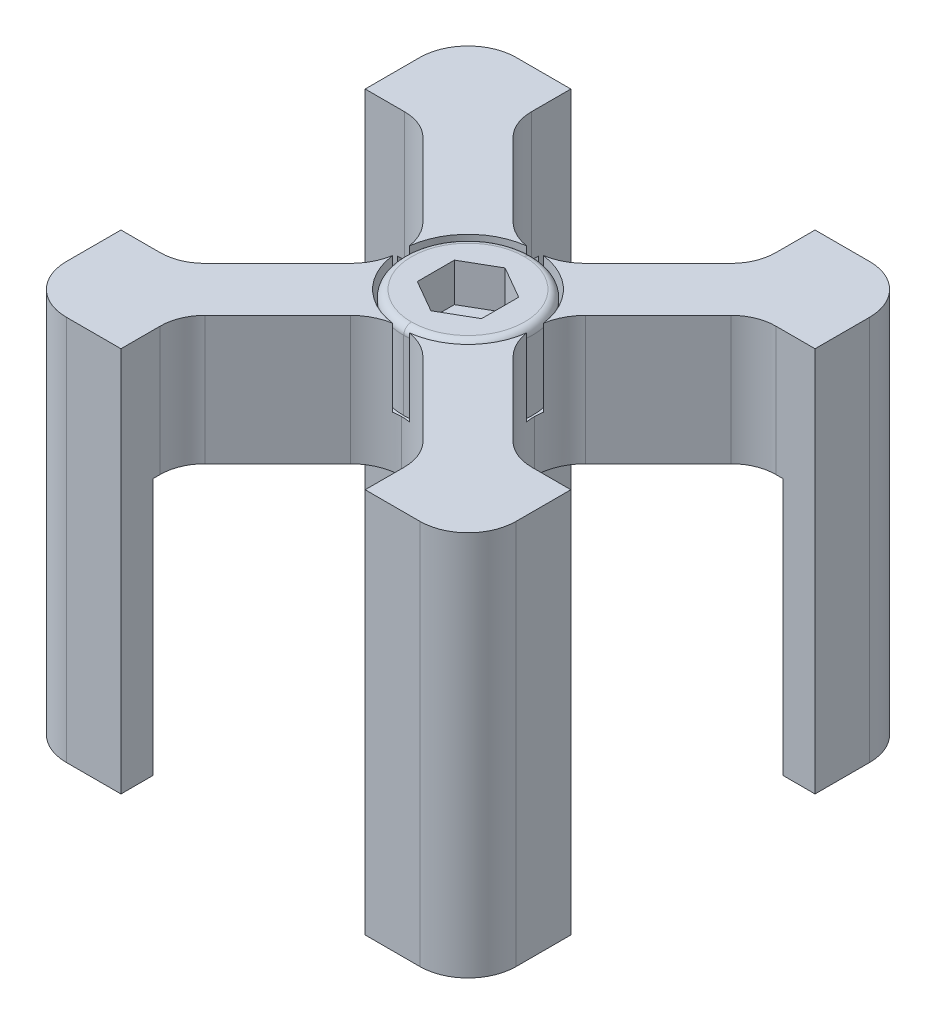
ISO-10303-21;
HEADER;
FILE_DESCRIPTION(('STEP AP214'),'2;1');
FILE_NAME('part.step','',(''),(''),'','','');
FILE_SCHEMA(('AUTOMOTIVE_DESIGN { 1 0 10303 214 1 1 1 1 }'));
ENDSEC;
DATA;
#1=APPLICATION_CONTEXT('core data for automotive mechanical design processes');
#2=APPLICATION_PROTOCOL_DEFINITION('international standard','automotive_design',2000,#1);
#3=PRODUCT_CONTEXT('',#1,'mechanical');
#4=PRODUCT('Part','Part','',(#3));
#5=PRODUCT_RELATED_PRODUCT_CATEGORY('part','',(#4));
#6=PRODUCT_DEFINITION_FORMATION('','',#4);
#7=PRODUCT_DEFINITION_CONTEXT('part definition',#1,'design');
#8=PRODUCT_DEFINITION('design','',#6,#7);
#9=PRODUCT_DEFINITION_SHAPE('','',#8);
#10=(LENGTH_UNIT() NAMED_UNIT(*) SI_UNIT(.MILLI.,.METRE.));
#11=(NAMED_UNIT(*) PLANE_ANGLE_UNIT() SI_UNIT($,.RADIAN.));
#12=(NAMED_UNIT(*) SI_UNIT($,.STERADIAN.) SOLID_ANGLE_UNIT());
#13=UNCERTAINTY_MEASURE_WITH_UNIT(LENGTH_MEASURE(1.E-05),#10,'distance_accuracy_value','');
#14=(GEOMETRIC_REPRESENTATION_CONTEXT(3) GLOBAL_UNCERTAINTY_ASSIGNED_CONTEXT((#13)) GLOBAL_UNIT_ASSIGNED_CONTEXT((#10,
#11,#12)) REPRESENTATION_CONTEXT('',''));
#15=CARTESIAN_POINT('',(0.,0.,0.));
#16=DIRECTION('',(0.,0.,1.));
#17=DIRECTION('',(1.,0.,0.));
#18=AXIS2_PLACEMENT_3D('',#15,#16,#17);
#19=CARTESIAN_POINT('',(-8.72978305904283,-59.,-8.72978305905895));
#20=DIRECTION('',(0.,1.,0.));
#21=DIRECTION('',(1.,0.,0.));
#22=AXIS2_PLACEMENT_3D('',#19,#20,#21);
#23=PLANE('',#22);
#24=DIRECTION('',(1.,0.,0.));
#25=VECTOR('',#24,1.);
#26=CARTESIAN_POINT('',(-7.61489152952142,-59.,15.));
#27=LINE('',#26,#25);
#28=CARTESIAN_POINT('',(-13.,-59.,15.));
#29=VERTEX_POINT('',#28);
#30=CARTESIAN_POINT('',(-9.5,-59.,15.));
#31=VERTEX_POINT('',#30);
#32=EDGE_CURVE('E717',#29,#31,#27,.T.);
#33=ORIENTED_EDGE('',*,*,#32,.T.);
#34=DIRECTION('',(0.,0.,1.));
#35=VECTOR('',#34,1.);
#36=CARTESIAN_POINT('',(-9.5,-59.,14.44974747));
#37=LINE('',#36,#35);
#38=CARTESIAN_POINT('',(-9.5,-59.,17.5));
#39=VERTEX_POINT('',#38);
#40=EDGE_CURVE('E888',#31,#39,#37,.T.);
#41=ORIENTED_EDGE('',*,*,#40,.T.);
#42=DIRECTION('',(-1.,0.,0.));
#43=VECTOR('',#42,1.);
#44=CARTESIAN_POINT('',(-9.5,-59.,17.5));
#45=LINE('',#44,#43);
#46=CARTESIAN_POINT('',(-13.75,-59.,17.5));
#47=VERTEX_POINT('',#46);
#48=EDGE_CURVE('E706',#39,#47,#45,.T.);
#49=ORIENTED_EDGE('',*,*,#48,.T.);
#50=CARTESIAN_POINT('',(-13.7500000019,-59.,13.7500000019));
#51=DIRECTION('',(0.,1.,0.));
#52=DIRECTION('',(-1.,0.,-5.00909417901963E-10));
#53=AXIS2_PLACEMENT_3D('',#50,#51,#52);
#54=CIRCLE('',#53,3.7499999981);
#55=CARTESIAN_POINT('',(-17.5,-59.,13.7500000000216));
#56=VERTEX_POINT('',#55);
#57=EDGE_CURVE('E705',#56,#47,#54,.T.);
#58=ORIENTED_EDGE('',*,*,#57,.F.);
#59=DIRECTION('',(0.,0.,-1.));
#60=VECTOR('',#59,1.);
#61=CARTESIAN_POINT('',(-17.5,-59.,13.75));
#62=LINE('',#61,#60);
#63=CARTESIAN_POINT('',(-17.5,-59.,9.5));
#64=VERTEX_POINT('',#63);
#65=EDGE_CURVE('E1061',#56,#64,#62,.T.);
#66=ORIENTED_EDGE('',*,*,#65,.T.);
#67=DIRECTION('',(1.,0.,0.));
#68=VECTOR('',#67,1.);
#69=CARTESIAN_POINT('',(-17.5,-59.,9.5));
#70=LINE('',#69,#68);
#71=CARTESIAN_POINT('',(-15.,-59.,9.5));
#72=VERTEX_POINT('',#71);
#73=EDGE_CURVE('E57',#64,#72,#70,.T.);
#74=ORIENTED_EDGE('',*,*,#73,.T.);
#75=DIRECTION('',(0.,0.,1.));
#76=VECTOR('',#75,1.);
#77=CARTESIAN_POINT('',(-15.,-59.,-4.36489152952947));
#78=LINE('',#77,#76);
#79=CARTESIAN_POINT('',(-15.,-59.,13.));
#80=VERTEX_POINT('',#79);
#81=EDGE_CURVE('E469',#72,#80,#78,.T.);
#82=ORIENTED_EDGE('',*,*,#81,.T.);
#83=CARTESIAN_POINT('',(-13.,-59.,13.));
#84=DIRECTION('',(0.,1.,0.));
#85=DIRECTION('',(-1.,0.,0.));
#86=AXIS2_PLACEMENT_3D('',#83,#84,#85);
#87=CIRCLE('',#86,2.);
#88=EDGE_CURVE('E456',#80,#29,#87,.T.);
#89=ORIENTED_EDGE('',*,*,#88,.T.);
#90=EDGE_LOOP('',(#33,#41,#49,#58,#66,#74,#82,#89));
#91=FACE_BOUND('',#90,.T.);
#92=ADVANCED_FACE('F38',(#91),#23,.F.);
#93=CARTESIAN_POINT('',(-8.72978305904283,-29.,-8.72978305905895));
#94=DIRECTION('',(0.,1.,0.));
#95=DIRECTION('',(1.,0.,0.));
#96=AXIS2_PLACEMENT_3D('',#93,#94,#95);
#97=PLANE('',#96);
#98=CARTESIAN_POINT('',(0.,-29.,0.));
#99=DIRECTION('',(0.,-1.,0.));
#100=DIRECTION('',(1.,0.,0.));
#101=AXIS2_PLACEMENT_3D('',#98,#99,#100);
#102=CIRCLE('',#101,5.25);
#103=CARTESIAN_POINT('',(0.648569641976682,-29.,-5.20978477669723));
#104=VERTEX_POINT('',#103);
#105=CARTESIAN_POINT('',(5.20978477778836,-29.,-0.648569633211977));
#106=VERTEX_POINT('',#105);
#107=EDGE_CURVE('E850',#104,#106,#102,.T.);
#108=ORIENTED_EDGE('',*,*,#107,.T.);
#109=CARTESIAN_POINT('',(9.1568542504,-29.,9.60000123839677E-09));
#110=DIRECTION('',(0.,1.,0.));
#111=DIRECTION('',(-0.707106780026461,0.,-0.707106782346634));
#112=AXIS2_PLACEMENT_3D('',#109,#110,#111);
#113=CIRCLE('',#112,4.0000000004);
#114=CARTESIAN_POINT('',(6.32842713,-29.,-2.82842712));
#115=VERTEX_POINT('',#114);
#116=EDGE_CURVE('E570',#115,#106,#113,.T.);
#117=ORIENTED_EDGE('',*,*,#116,.F.);
#118=DIRECTION('',(-0.707106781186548,0.,0.707106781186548));
#119=VECTOR('',#118,1.);
#120=CARTESIAN_POINT('',(11.97487374,-29.,-8.47487373));
#121=LINE('',#120,#119);
#122=CARTESIAN_POINT('',(11.9748737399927,-29.,-8.47487373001));
#123=VERTEX_POINT('',#122);
#124=EDGE_CURVE('E569',#123,#115,#121,.T.);
#125=ORIENTED_EDGE('',*,*,#124,.F.);
#126=CARTESIAN_POINT('',(14.4497474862,-29.,-5.99999998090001));
#127=DIRECTION('',(0.,1.,0.));
#128=DIRECTION('',(-4.63733836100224E-09,0.,-1.));
#129=AXIS2_PLACEMENT_3D('',#126,#127,#128);
#130=CIRCLE('',#129,3.50000001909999);
#131=CARTESIAN_POINT('',(14.44974747,-29.,-9.5));
#132=VERTEX_POINT('',#131);
#133=EDGE_CURVE('E791',#132,#123,#130,.T.);
#134=ORIENTED_EDGE('',*,*,#133,.F.);
#135=DIRECTION('',(-1.,0.,0.));
#136=VECTOR('',#135,1.);
#137=CARTESIAN_POINT('',(17.5,-29.,-9.5));
#138=LINE('',#137,#136);
#139=CARTESIAN_POINT('',(17.5,-29.,-9.5));
#140=VERTEX_POINT('',#139);
#141=EDGE_CURVE('E601',#140,#132,#138,.T.);
#142=ORIENTED_EDGE('',*,*,#141,.F.);
#143=DIRECTION('',(0.,0.,1.));
#144=VECTOR('',#143,1.);
#145=CARTESIAN_POINT('',(17.5,-29.,-13.75));
#146=LINE('',#145,#144);
#147=CARTESIAN_POINT('',(17.5,-29.,-13.7500000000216));
#148=VERTEX_POINT('',#147);
#149=EDGE_CURVE('E498',#148,#140,#146,.T.);
#150=ORIENTED_EDGE('',*,*,#149,.F.);
#151=CARTESIAN_POINT('',(13.7500000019,-29.,-13.7500000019));
#152=DIRECTION('',(0.,-1.,0.));
#153=DIRECTION('',(1.,0.,5.00909417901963E-10));
#154=AXIS2_PLACEMENT_3D('',#151,#152,#153);
#155=CIRCLE('',#154,3.7499999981);
#156=CARTESIAN_POINT('',(13.75,-29.,-17.5));
#157=VERTEX_POINT('',#156);
#158=EDGE_CURVE('E769',#157,#148,#155,.T.);
#159=ORIENTED_EDGE('',*,*,#158,.F.);
#160=DIRECTION('',(1.,0.,0.));
#161=VECTOR('',#160,1.);
#162=CARTESIAN_POINT('',(9.5,-29.,-17.5));
#163=LINE('',#162,#161);
#164=CARTESIAN_POINT('',(9.5,-29.,-17.5));
#165=VERTEX_POINT('',#164);
#166=EDGE_CURVE('E662',#165,#157,#163,.T.);
#167=ORIENTED_EDGE('',*,*,#166,.F.);
#168=DIRECTION('',(0.,0.,-1.));
#169=VECTOR('',#168,1.);
#170=CARTESIAN_POINT('',(9.5,-29.,-14.44974747));
#171=LINE('',#170,#169);
#172=CARTESIAN_POINT('',(9.5,-29.,-14.4497474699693));
#173=VERTEX_POINT('',#172);
#174=EDGE_CURVE('E663',#173,#165,#171,.T.);
#175=ORIENTED_EDGE('',*,*,#174,.F.);
#176=CARTESIAN_POINT('',(5.99999998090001,-29.,-14.4497474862));
#177=DIRECTION('',(0.,1.,0.));
#178=DIRECTION('',(0.707106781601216,0.,0.707106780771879));
#179=AXIS2_PLACEMENT_3D('',#176,#177,#178);
#180=CIRCLE('',#179,3.50000001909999);
#181=CARTESIAN_POINT('',(8.47487373,-29.,-11.97487374));
#182=VERTEX_POINT('',#181);
#183=EDGE_CURVE('E903',#182,#173,#180,.T.);
#184=ORIENTED_EDGE('',*,*,#183,.F.);
#185=DIRECTION('',(0.707106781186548,0.,-0.707106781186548));
#186=VECTOR('',#185,1.);
#187=CARTESIAN_POINT('',(2.82842712,-29.,-6.32842713));
#188=LINE('',#187,#186);
#189=CARTESIAN_POINT('',(2.82842711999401,-29.,-6.32842712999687));
#190=VERTEX_POINT('',#189);
#191=EDGE_CURVE('E556',#190,#182,#188,.T.);
#192=ORIENTED_EDGE('',*,*,#191,.F.);
#193=CARTESIAN_POINT('',(9.6000132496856E-09,-29.,-9.15685420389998));
#194=DIRECTION('',(0.,1.,0.));
#195=DIRECTION('',(-2.39983144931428E-09,0.,1.));
#196=AXIS2_PLACEMENT_3D('',#193,#194,#195);
#197=CIRCLE('',#196,3.99999995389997);
#198=EDGE_CURVE('E935',#104,#190,#197,.T.);
#199=ORIENTED_EDGE('',*,*,#198,.F.);
#200=EDGE_LOOP('',(#108,#117,#125,#134,#142,#150,#159,#167,#175,#184,#192,#199));
#201=FACE_BOUND('',#200,.T.);
#202=ADVANCED_FACE('F1363',(#201),#97,.T.);
#203=CARTESIAN_POINT('',(-11.6250000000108,-59.,-17.5));
#204=DIRECTION('',(0.,0.,-1.));
#205=DIRECTION('',(0.,-1.,0.));
#206=AXIS2_PLACEMENT_3D('',#203,#204,#205);
#207=PLANE('',#206);
#208=DIRECTION('',(1.,0.,0.));
#209=VECTOR('',#208,1.);
#210=CARTESIAN_POINT('',(-13.75,-29.,-17.5));
#211=LINE('',#210,#209);
#212=CARTESIAN_POINT('',(-13.7500000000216,-29.,-17.5));
#213=VERTEX_POINT('',#212);
#214=CARTESIAN_POINT('',(-9.5,-29.,-17.5));
#215=VERTEX_POINT('',#214);
#216=EDGE_CURVE('E564',#213,#215,#211,.T.);
#217=ORIENTED_EDGE('',*,*,#216,.T.);
#218=DIRECTION('',(0.,1.,0.));
#219=VECTOR('',#218,1.);
#220=CARTESIAN_POINT('',(-9.5,-59.,-17.5));
#221=LINE('',#220,#219);
#222=CARTESIAN_POINT('',(-9.5,-59.,-17.5));
#223=VERTEX_POINT('',#222);
#224=EDGE_CURVE('E1217',#223,#215,#221,.T.);
#225=ORIENTED_EDGE('',*,*,#224,.F.);
#226=DIRECTION('',(1.,0.,0.));
#227=VECTOR('',#226,1.);
#228=CARTESIAN_POINT('',(-13.75,-59.,-17.5));
#229=LINE('',#228,#227);
#230=CARTESIAN_POINT('',(-13.7500000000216,-59.,-17.5));
#231=VERTEX_POINT('',#230);
#232=EDGE_CURVE('E686',#231,#223,#229,.T.);
#233=ORIENTED_EDGE('',*,*,#232,.F.);
#234=DIRECTION('',(0.,1.,0.));
#235=VECTOR('',#234,1.);
#236=CARTESIAN_POINT('',(-13.7500000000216,-59.,-17.5));
#237=LINE('',#236,#235);
#238=EDGE_CURVE('E11',#231,#213,#237,.T.);
#239=ORIENTED_EDGE('',*,*,#238,.T.);
#240=EDGE_LOOP('',(#217,#225,#233,#239));
#241=FACE_BOUND('',#240,.T.);
#242=ADVANCED_FACE('F1419',(#241),#207,.T.);
#243=CARTESIAN_POINT('',(-13.7500000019,-59.,-13.7500000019));
#244=DIRECTION('',(0.,1.,0.));
#245=DIRECTION('',(5.00909417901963E-10,0.,-1.));
#246=AXIS2_PLACEMENT_3D('',#243,#244,#245);
#247=CYLINDRICAL_SURFACE('',#246,3.7499999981);
#248=CARTESIAN_POINT('',(-13.7500000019,-29.,-13.7500000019));
#249=DIRECTION('',(0.,-1.,0.));
#250=DIRECTION('',(5.00909417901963E-10,0.,-1.));
#251=AXIS2_PLACEMENT_3D('',#248,#249,#250);
#252=CIRCLE('',#251,3.7499999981);
#253=CARTESIAN_POINT('',(-17.5,-29.,-13.75));
#254=VERTEX_POINT('',#253);
#255=EDGE_CURVE('E658',#254,#213,#252,.T.);
#256=ORIENTED_EDGE('',*,*,#255,.T.);
#257=ORIENTED_EDGE('',*,*,#238,.F.);
#258=CARTESIAN_POINT('',(-13.7500000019,-59.,-13.7500000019));
#259=DIRECTION('',(0.,1.,0.));
#260=DIRECTION('',(5.00909417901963E-10,0.,-1.));
#261=AXIS2_PLACEMENT_3D('',#258,#259,#260);
#262=CIRCLE('',#261,3.7499999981);
#263=CARTESIAN_POINT('',(-17.5,-59.,-13.75));
#264=VERTEX_POINT('',#263);
#265=EDGE_CURVE('E690',#231,#264,#262,.T.);
#266=ORIENTED_EDGE('',*,*,#265,.T.);
#267=DIRECTION('',(0.,1.,0.));
#268=VECTOR('',#267,1.);
#269=CARTESIAN_POINT('',(-17.5,-59.,-13.75));
#270=LINE('',#269,#268);
#271=EDGE_CURVE('E48',#264,#254,#270,.T.);
#272=ORIENTED_EDGE('',*,*,#271,.T.);
#273=EDGE_LOOP('',(#256,#257,#266,#272));
#274=FACE_BOUND('',#273,.T.);
#275=ADVANCED_FACE('F1331',(#274),#247,.T.);
#276=CARTESIAN_POINT('',(-17.5,-59.,-11.625));
#277=DIRECTION('',(-1.,0.,0.));
#278=DIRECTION('',(0.,0.,1.));
#279=AXIS2_PLACEMENT_3D('',#276,#277,#278);
#280=PLANE('',#279);
#281=DIRECTION('',(0.,0.,-1.));
#282=VECTOR('',#281,1.);
#283=CARTESIAN_POINT('',(-17.5,-29.,-9.5));
#284=LINE('',#283,#282);
#285=CARTESIAN_POINT('',(-17.5,-29.,-9.5));
#286=VERTEX_POINT('',#285);
#287=EDGE_CURVE('E721',#286,#254,#284,.T.);
#288=ORIENTED_EDGE('',*,*,#287,.T.);
#289=ORIENTED_EDGE('',*,*,#271,.F.);
#290=DIRECTION('',(0.,0.,-1.));
#291=VECTOR('',#290,1.);
#292=CARTESIAN_POINT('',(-17.5,-59.,-9.5));
#293=LINE('',#292,#291);
#294=CARTESIAN_POINT('',(-17.5,-59.,-9.5));
#295=VERTEX_POINT('',#294);
#296=EDGE_CURVE('E631',#295,#264,#293,.T.);
#297=ORIENTED_EDGE('',*,*,#296,.F.);
#298=DIRECTION('',(0.,1.,0.));
#299=VECTOR('',#298,1.);
#300=CARTESIAN_POINT('',(-17.5,-59.,-9.5));
#301=LINE('',#300,#299);
#302=EDGE_CURVE('E494',#295,#286,#301,.T.);
#303=ORIENTED_EDGE('',*,*,#302,.T.);
#304=EDGE_LOOP('',(#288,#289,#297,#303));
#305=FACE_BOUND('',#304,.T.);
#306=ADVANCED_FACE('F1319',(#305),#280,.T.);
#307=CARTESIAN_POINT('',(-15.9748737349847,-59.,-9.5));
#308=DIRECTION('',(0.,0.,1.));
#309=DIRECTION('',(1.,0.,0.));
#310=AXIS2_PLACEMENT_3D('',#307,#308,#309);
#311=PLANE('',#310);
#312=DIRECTION('',(1.,0.,0.));
#313=VECTOR('',#312,1.);
#314=CARTESIAN_POINT('',(-7.98743686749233,-39.,-9.5));
#315=LINE('',#314,#313);
#316=CARTESIAN_POINT('',(-15.,-39.,-9.5));
#317=VERTEX_POINT('',#316);
#318=CARTESIAN_POINT('',(-14.4497474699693,-39.,-9.5));
#319=VERTEX_POINT('',#318);
#320=EDGE_CURVE('E489',#317,#319,#315,.T.);
#321=ORIENTED_EDGE('',*,*,#320,.T.);
#322=DIRECTION('',(0.,1.,0.));
#323=VECTOR('',#322,1.);
#324=CARTESIAN_POINT('',(-14.4497474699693,-59.,-9.5));
#325=LINE('',#324,#323);
#326=CARTESIAN_POINT('',(-14.4497474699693,-29.,-9.5));
#327=VERTEX_POINT('',#326);
#328=EDGE_CURVE('E497',#319,#327,#325,.T.);
#329=ORIENTED_EDGE('',*,*,#328,.T.);
#330=DIRECTION('',(-1.,0.,0.));
#331=VECTOR('',#330,1.);
#332=CARTESIAN_POINT('',(-14.44974747,-29.,-9.5));
#333=LINE('',#332,#331);
#334=EDGE_CURVE('E718',#327,#286,#333,.T.);
#335=ORIENTED_EDGE('',*,*,#334,.T.);
#336=ORIENTED_EDGE('',*,*,#302,.F.);
#337=DIRECTION('',(-1.,0.,0.));
#338=VECTOR('',#337,1.);
#339=CARTESIAN_POINT('',(-14.44974747,-59.,-9.5));
#340=LINE('',#339,#338);
#341=CARTESIAN_POINT('',(-15.,-59.,-9.5));
#342=VERTEX_POINT('',#341);
#343=EDGE_CURVE('E628',#342,#295,#340,.T.);
#344=ORIENTED_EDGE('',*,*,#343,.F.);
#345=DIRECTION('',(0.,1.,0.));
#346=VECTOR('',#345,1.);
#347=CARTESIAN_POINT('',(-15.,-59.,-9.5));
#348=LINE('',#347,#346);
#349=EDGE_CURVE('E733',#342,#317,#348,.T.);
#350=ORIENTED_EDGE('',*,*,#349,.T.);
#351=EDGE_LOOP('',(#321,#329,#335,#336,#344,#350));
#352=FACE_BOUND('',#351,.T.);
#353=ADVANCED_FACE('F1324',(#352),#311,.T.);
#354=CARTESIAN_POINT('',(-14.4497474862,-59.,-5.99999998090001));
#355=DIRECTION('',(0.,1.,0.));
#356=DIRECTION('',(0.707106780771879,0.,-0.707106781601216));
#357=AXIS2_PLACEMENT_3D('',#354,#355,#356);
#358=CYLINDRICAL_SURFACE('',#357,3.50000001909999);
#359=CARTESIAN_POINT('',(-14.4497474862,-39.,-5.99999998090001));
#360=DIRECTION('',(0.,-1.,0.));
#361=DIRECTION('',(0.707106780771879,0.,-0.707106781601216));
#362=AXIS2_PLACEMENT_3D('',#359,#360,#361);
#363=CIRCLE('',#362,3.50000001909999);
#364=CARTESIAN_POINT('',(-11.97487374,-39.,-8.47487373));
#365=VERTEX_POINT('',#364);
#366=EDGE_CURVE('E493',#319,#365,#363,.T.);
#367=ORIENTED_EDGE('',*,*,#366,.T.);
#368=DIRECTION('',(0.,1.,0.));
#369=VECTOR('',#368,1.);
#370=CARTESIAN_POINT('',(-11.97487374,-59.,-8.47487373));
#371=LINE('',#370,#369);
#372=CARTESIAN_POINT('',(-11.97487374,-29.,-8.47487373));
#373=VERTEX_POINT('',#372);
#374=EDGE_CURVE('E700',#365,#373,#371,.T.);
#375=ORIENTED_EDGE('',*,*,#374,.T.);
#376=CARTESIAN_POINT('',(-14.4497474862,-29.,-5.99999998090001));
#377=DIRECTION('',(0.,1.,0.));
#378=DIRECTION('',(0.707106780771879,0.,-0.707106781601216));
#379=AXIS2_PLACEMENT_3D('',#376,#377,#378);
#380=CIRCLE('',#379,3.50000001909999);
#381=EDGE_CURVE('E675',#373,#327,#380,.T.);
#382=ORIENTED_EDGE('',*,*,#381,.T.);
#383=ORIENTED_EDGE('',*,*,#328,.F.);
#384=EDGE_LOOP('',(#367,#375,#382,#383));
#385=FACE_BOUND('',#384,.T.);
#386=ADVANCED_FACE('F1350',(#385),#358,.F.);
#387=CARTESIAN_POINT('',(-9.15165043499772,-59.,-5.65165042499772));
#388=DIRECTION('',(-0.707106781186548,0.,0.707106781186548));
#389=DIRECTION('',(0.,1.,0.));
#390=AXIS2_PLACEMENT_3D('',#387,#388,#389);
#391=PLANE('',#390);
#392=DIRECTION('',(0.707106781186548,0.,0.707106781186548));
#393=VECTOR('',#392,1.);
#394=CARTESIAN_POINT('',(-5.45082521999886,-39.,-1.95082520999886));
#395=LINE('',#394,#393);
#396=CARTESIAN_POINT('',(-6.32842712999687,-39.,-2.82842711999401));
#397=VERTEX_POINT('',#396);
#398=EDGE_CURVE('E550',#365,#397,#395,.T.);
#399=ORIENTED_EDGE('',*,*,#398,.T.);
#400=DIRECTION('',(0.,1.,0.));
#401=VECTOR('',#400,1.);
#402=CARTESIAN_POINT('',(-6.32842712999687,-59.,-2.82842711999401));
#403=LINE('',#402,#401);
#404=CARTESIAN_POINT('',(-6.32842712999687,-29.,-2.82842711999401));
#405=VERTEX_POINT('',#404);
#406=EDGE_CURVE('E698',#397,#405,#403,.T.);
#407=ORIENTED_EDGE('',*,*,#406,.T.);
#408=DIRECTION('',(-0.707106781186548,0.,-0.707106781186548));
#409=VECTOR('',#408,1.);
#410=CARTESIAN_POINT('',(-6.32842713,-29.,-2.82842712));
#411=LINE('',#410,#409);
#412=EDGE_CURVE('E671',#405,#373,#411,.T.);
#413=ORIENTED_EDGE('',*,*,#412,.T.);
#414=ORIENTED_EDGE('',*,*,#374,.F.);
#415=EDGE_LOOP('',(#399,#407,#413,#414));
#416=FACE_BOUND('',#415,.T.);
#417=ADVANCED_FACE('F1496',(#416),#391,.T.);
#418=CARTESIAN_POINT('',(-9.15685420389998,-59.,-9.6000132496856E-09));
#419=DIRECTION('',(0.,1.,0.));
#420=DIRECTION('',(1.,0.,2.39983144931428E-09));
#421=AXIS2_PLACEMENT_3D('',#418,#419,#420);
#422=CYLINDRICAL_SURFACE('',#421,3.99999995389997);
#423=DIRECTION('',(0.,1.,0.));
#424=VECTOR('',#423,1.);
#425=CARTESIAN_POINT('',(-5.20978477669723,-32.,-0.648569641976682));
#426=LINE('',#425,#424);
#427=CARTESIAN_POINT('',(-5.20978477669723,-35.,-0.648569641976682));
#428=VERTEX_POINT('',#427);
#429=CARTESIAN_POINT('',(-5.20978477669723,-29.,-0.648569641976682));
#430=VERTEX_POINT('',#429);
#431=EDGE_CURVE('E810',#428,#430,#426,.T.);
#432=ORIENTED_EDGE('',*,*,#431,.T.);
#433=CARTESIAN_POINT('',(-9.15685420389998,-29.,-9.6000132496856E-09));
#434=DIRECTION('',(0.,1.,0.));
#435=DIRECTION('',(1.,0.,2.39983144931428E-09));
#436=AXIS2_PLACEMENT_3D('',#433,#434,#435);
#437=CIRCLE('',#436,3.99999995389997);
#438=EDGE_CURVE('E674',#430,#405,#437,.T.);
#439=ORIENTED_EDGE('',*,*,#438,.T.);
#440=ORIENTED_EDGE('',*,*,#406,.F.);
#441=CARTESIAN_POINT('',(-9.15685420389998,-39.,-9.6000132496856E-09));
#442=DIRECTION('',(0.,-1.,0.));
#443=DIRECTION('',(1.,0.,2.39983144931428E-09));
#444=AXIS2_PLACEMENT_3D('',#441,#442,#443);
#445=CIRCLE('',#444,3.99999995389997);
#446=CARTESIAN_POINT('',(-5.15685425,-39.,0.));
#447=VERTEX_POINT('',#446);
#448=EDGE_CURVE('E548',#397,#447,#445,.T.);
#449=ORIENTED_EDGE('',*,*,#448,.T.);
#450=DIRECTION('',(0.,1.,0.));
#451=VECTOR('',#450,1.);
#452=CARTESIAN_POINT('',(-5.15685425,-59.,0.));
#453=LINE('',#452,#451);
#454=CARTESIAN_POINT('',(-5.15685425,-35.,0.));
#455=VERTEX_POINT('',#454);
#456=EDGE_CURVE('E987',#447,#455,#453,.T.);
#457=ORIENTED_EDGE('',*,*,#456,.T.);
#458=CARTESIAN_POINT('',(-9.15685420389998,-35.,-9.6000132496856E-09));
#459=DIRECTION('',(0.,1.,0.));
#460=DIRECTION('',(1.,0.,2.39983144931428E-09));
#461=AXIS2_PLACEMENT_3D('',#458,#459,#460);
#462=CIRCLE('',#461,3.99999995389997);
#463=EDGE_CURVE('E729',#455,#428,#462,.T.);
#464=ORIENTED_EDGE('',*,*,#463,.T.);
#465=EDGE_LOOP('',(#432,#439,#440,#449,#457,#464));
#466=FACE_BOUND('',#465,.T.);
#467=ADVANCED_FACE('F1499',(#466),#422,.F.);
#468=CARTESIAN_POINT('',(-9.15165043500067,-59.,5.65165042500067));
#469=DIRECTION('',(-0.707106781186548,0.,-0.707106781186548));
#470=DIRECTION('',(-0.707106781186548,0.,0.707106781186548));
#471=AXIS2_PLACEMENT_3D('',#468,#469,#470);
#472=PLANE('',#471);
#473=DIRECTION('',(-0.707106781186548,0.,0.707106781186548));
#474=VECTOR('',#473,1.);
#475=CARTESIAN_POINT('',(-5.45082522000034,-39.,1.95082521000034));
#476=LINE('',#475,#474);
#477=CARTESIAN_POINT('',(-6.32842713,-39.,2.82842712));
#478=VERTEX_POINT('',#477);
#479=CARTESIAN_POINT('',(-11.9748737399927,-39.,8.47487373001));
#480=VERTEX_POINT('',#479);
#481=EDGE_CURVE('E551',#478,#480,#476,.T.);
#482=ORIENTED_EDGE('',*,*,#481,.T.);
#483=DIRECTION('',(0.,1.,0.));
#484=VECTOR('',#483,1.);
#485=CARTESIAN_POINT('',(-11.9748737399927,-59.,8.47487373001));
#486=LINE('',#485,#484);
#487=CARTESIAN_POINT('',(-11.9748737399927,-29.,8.47487373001));
#488=VERTEX_POINT('',#487);
#489=EDGE_CURVE('E701',#480,#488,#486,.T.);
#490=ORIENTED_EDGE('',*,*,#489,.T.);
#491=DIRECTION('',(0.707106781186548,0.,-0.707106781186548));
#492=VECTOR('',#491,1.);
#493=CARTESIAN_POINT('',(-11.97487374,-29.,8.47487373));
#494=LINE('',#493,#492);
#495=CARTESIAN_POINT('',(-6.32842713,-29.,2.82842712));
#496=VERTEX_POINT('',#495);
#497=EDGE_CURVE('E834',#488,#496,#494,.T.);
#498=ORIENTED_EDGE('',*,*,#497,.T.);
#499=DIRECTION('',(0.,1.,0.));
#500=VECTOR('',#499,1.);
#501=CARTESIAN_POINT('',(-6.32842713,-59.,2.82842712));
#502=LINE('',#501,#500);
#503=EDGE_CURVE('E999',#478,#496,#502,.T.);
#504=ORIENTED_EDGE('',*,*,#503,.F.);
#505=EDGE_LOOP('',(#482,#490,#498,#504));
#506=FACE_BOUND('',#505,.T.);
#507=ADVANCED_FACE('F1591',(#506),#472,.T.);
#508=CARTESIAN_POINT('',(-14.4497474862,-59.,5.99999998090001));
#509=DIRECTION('',(0.,1.,0.));
#510=DIRECTION('',(4.63733836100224E-09,0.,1.));
#511=AXIS2_PLACEMENT_3D('',#508,#509,#510);
#512=CYLINDRICAL_SURFACE('',#511,3.50000001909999);
#513=CARTESIAN_POINT('',(-14.4497474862,-39.,5.99999998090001));
#514=DIRECTION('',(0.,-1.,0.));
#515=DIRECTION('',(4.63733836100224E-09,0.,1.));
#516=AXIS2_PLACEMENT_3D('',#513,#514,#515);
#517=CIRCLE('',#516,3.50000001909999);
#518=CARTESIAN_POINT('',(-14.44974747,-39.,9.5));
#519=VERTEX_POINT('',#518);
#520=EDGE_CURVE('E509',#480,#519,#517,.T.);
#521=ORIENTED_EDGE('',*,*,#520,.T.);
#522=DIRECTION('',(0.,1.,0.));
#523=VECTOR('',#522,1.);
#524=CARTESIAN_POINT('',(-14.44974747,-59.,9.5));
#525=LINE('',#524,#523);
#526=CARTESIAN_POINT('',(-14.44974747,-29.,9.5));
#527=VERTEX_POINT('',#526);
#528=EDGE_CURVE('E983',#519,#527,#525,.T.);
#529=ORIENTED_EDGE('',*,*,#528,.T.);
#530=CARTESIAN_POINT('',(-14.4497474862,-29.,5.99999998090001));
#531=DIRECTION('',(0.,1.,0.));
#532=DIRECTION('',(4.63733836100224E-09,0.,1.));
#533=AXIS2_PLACEMENT_3D('',#530,#531,#532);
#534=CIRCLE('',#533,3.50000001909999);
#535=EDGE_CURVE('E831',#527,#488,#534,.T.);
#536=ORIENTED_EDGE('',*,*,#535,.T.);
#537=ORIENTED_EDGE('',*,*,#489,.F.);
#538=EDGE_LOOP('',(#521,#529,#536,#537));
#539=FACE_BOUND('',#538,.T.);
#540=ADVANCED_FACE('F1430',(#539),#512,.F.);
#541=CARTESIAN_POINT('',(-15.974873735,-59.,9.5));
#542=DIRECTION('',(0.,0.,-1.));
#543=DIRECTION('',(0.,-1.,0.));
#544=AXIS2_PLACEMENT_3D('',#541,#542,#543);
#545=PLANE('',#544);
#546=DIRECTION('',(0.,-1.,0.));
#547=VECTOR('',#546,1.);
#548=CARTESIAN_POINT('',(-15.,-59.,9.5));
#549=LINE('',#548,#547);
#550=CARTESIAN_POINT('',(-15.,-39.,9.5));
#551=VERTEX_POINT('',#550);
#552=EDGE_CURVE('E478',#551,#72,#549,.T.);
#553=ORIENTED_EDGE('',*,*,#552,.T.);
#554=ORIENTED_EDGE('',*,*,#73,.F.);
#555=DIRECTION('',(0.,1.,0.));
#556=VECTOR('',#555,1.);
#557=CARTESIAN_POINT('',(-17.5,-59.,9.5));
#558=LINE('',#557,#556);
#559=CARTESIAN_POINT('',(-17.5,-29.,9.5));
#560=VERTEX_POINT('',#559);
#561=EDGE_CURVE('E894',#64,#560,#558,.T.);
#562=ORIENTED_EDGE('',*,*,#561,.T.);
#563=DIRECTION('',(1.,0.,0.));
#564=VECTOR('',#563,1.);
#565=CARTESIAN_POINT('',(-17.5,-29.,9.5));
#566=LINE('',#565,#564);
#567=EDGE_CURVE('E805',#560,#527,#566,.T.);
#568=ORIENTED_EDGE('',*,*,#567,.T.);
#569=ORIENTED_EDGE('',*,*,#528,.F.);
#570=DIRECTION('',(-1.,0.,0.));
#571=VECTOR('',#570,1.);
#572=CARTESIAN_POINT('',(-7.9874368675,-39.,9.5));
#573=LINE('',#572,#571);
#574=EDGE_CURVE('E507',#519,#551,#573,.T.);
#575=ORIENTED_EDGE('',*,*,#574,.T.);
#576=EDGE_LOOP('',(#553,#554,#562,#568,#569,#575));
#577=FACE_BOUND('',#576,.T.);
#578=ADVANCED_FACE('F1426',(#577),#545,.T.);
#579=CARTESIAN_POINT('',(-17.5,-59.,11.6250000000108));
#580=DIRECTION('',(-1.,0.,0.));
#581=DIRECTION('',(0.,0.,1.));
#582=AXIS2_PLACEMENT_3D('',#579,#580,#581);
#583=PLANE('',#582);
#584=DIRECTION('',(0.,0.,-1.));
#585=VECTOR('',#584,1.);
#586=CARTESIAN_POINT('',(-17.5,-29.,13.75));
#587=LINE('',#586,#585);
#588=CARTESIAN_POINT('',(-17.5,-29.,13.7500000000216));
#589=VERTEX_POINT('',#588);
#590=EDGE_CURVE('E801',#589,#560,#587,.T.);
#591=ORIENTED_EDGE('',*,*,#590,.T.);
#592=ORIENTED_EDGE('',*,*,#561,.F.);
#593=ORIENTED_EDGE('',*,*,#65,.F.);
#594=DIRECTION('',(0.,1.,0.));
#595=VECTOR('',#594,1.);
#596=CARTESIAN_POINT('',(-17.5,-59.,13.7500000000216));
#597=LINE('',#596,#595);
#598=EDGE_CURVE('E703',#56,#589,#597,.T.);
#599=ORIENTED_EDGE('',*,*,#598,.T.);
#600=EDGE_LOOP('',(#591,#592,#593,#599));
#601=FACE_BOUND('',#600,.T.);
#602=ADVANCED_FACE('F1429',(#601),#583,.T.);
#603=CARTESIAN_POINT('',(-13.7500000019,-59.,13.7500000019));
#604=DIRECTION('',(0.,1.,0.));
#605=DIRECTION('',(-1.,0.,-5.00909417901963E-10));
#606=AXIS2_PLACEMENT_3D('',#603,#604,#605);
#607=CYLINDRICAL_SURFACE('',#606,3.7499999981);
#608=CARTESIAN_POINT('',(-13.7500000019,-29.,13.7500000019));
#609=DIRECTION('',(0.,-1.,0.));
#610=DIRECTION('',(-1.,0.,-5.00909417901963E-10));
#611=AXIS2_PLACEMENT_3D('',#608,#609,#610);
#612=CIRCLE('',#611,3.7499999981);
#613=CARTESIAN_POINT('',(-13.75,-29.,17.5));
#614=VERTEX_POINT('',#613);
#615=EDGE_CURVE('E804',#614,#589,#612,.T.);
#616=ORIENTED_EDGE('',*,*,#615,.T.);
#617=ORIENTED_EDGE('',*,*,#598,.F.);
#618=ORIENTED_EDGE('',*,*,#57,.T.);
#619=DIRECTION('',(0.,1.,0.));
#620=VECTOR('',#619,1.);
#621=CARTESIAN_POINT('',(-13.75,-59.,17.5));
#622=LINE('',#621,#620);
#623=EDGE_CURVE('E1054',#47,#614,#622,.T.);
#624=ORIENTED_EDGE('',*,*,#623,.T.);
#625=EDGE_LOOP('',(#616,#617,#618,#624));
#626=FACE_BOUND('',#625,.T.);
#627=ADVANCED_FACE('F1548',(#626),#607,.T.);
#628=CARTESIAN_POINT('',(-11.625,-59.,17.5));
#629=DIRECTION('',(0.,0.,1.));
#630=DIRECTION('',(1.,0.,0.));
#631=AXIS2_PLACEMENT_3D('',#628,#629,#630);
#632=PLANE('',#631);
#633=DIRECTION('',(-1.,0.,0.));
#634=VECTOR('',#633,1.);
#635=CARTESIAN_POINT('',(-9.5,-29.,17.5));
#636=LINE('',#635,#634);
#637=CARTESIAN_POINT('',(-9.5,-29.,17.5));
#638=VERTEX_POINT('',#637);
#639=EDGE_CURVE('E655',#638,#614,#636,.T.);
#640=ORIENTED_EDGE('',*,*,#639,.T.);
#641=ORIENTED_EDGE('',*,*,#623,.F.);
#642=ORIENTED_EDGE('',*,*,#48,.F.);
#643=DIRECTION('',(0.,1.,0.));
#644=VECTOR('',#643,1.);
#645=CARTESIAN_POINT('',(-9.5,-59.,17.5));
#646=LINE('',#645,#644);
#647=EDGE_CURVE('E886',#39,#638,#646,.T.);
#648=ORIENTED_EDGE('',*,*,#647,.T.);
#649=EDGE_LOOP('',(#640,#641,#642,#648));
#650=FACE_BOUND('',#649,.T.);
#651=ADVANCED_FACE('F1494',(#650),#632,.T.);
#652=CARTESIAN_POINT('',(-9.5,-59.,15.9748737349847));
#653=DIRECTION('',(1.,0.,0.));
#654=DIRECTION('',(0.,1.,0.));
#655=AXIS2_PLACEMENT_3D('',#652,#653,#654);
#656=PLANE('',#655);
#657=DIRECTION('',(0.,0.,-1.));
#658=VECTOR('',#657,1.);
#659=CARTESIAN_POINT('',(-9.5,-39.,7.98743686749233));
#660=LINE('',#659,#658);
#661=CARTESIAN_POINT('',(-9.5,-39.,15.));
#662=VERTEX_POINT('',#661);
#663=CARTESIAN_POINT('',(-9.5,-39.,14.4497474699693));
#664=VERTEX_POINT('',#663);
#665=EDGE_CURVE('E779',#662,#664,#660,.T.);
#666=ORIENTED_EDGE('',*,*,#665,.T.);
#667=DIRECTION('',(0.,1.,0.));
#668=VECTOR('',#667,1.);
#669=CARTESIAN_POINT('',(-9.5,-59.,14.4497474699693));
#670=LINE('',#669,#668);
#671=CARTESIAN_POINT('',(-9.5,-29.,14.4497474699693));
#672=VERTEX_POINT('',#671);
#673=EDGE_CURVE('E848',#664,#672,#670,.T.);
#674=ORIENTED_EDGE('',*,*,#673,.T.);
#675=DIRECTION('',(0.,0.,1.));
#676=VECTOR('',#675,1.);
#677=CARTESIAN_POINT('',(-9.5,-29.,14.44974747));
#678=LINE('',#677,#676);
#679=EDGE_CURVE('E651',#672,#638,#678,.T.);
#680=ORIENTED_EDGE('',*,*,#679,.T.);
#681=ORIENTED_EDGE('',*,*,#647,.F.);
#682=ORIENTED_EDGE('',*,*,#40,.F.);
#683=DIRECTION('',(0.,1.,0.));
#684=VECTOR('',#683,1.);
#685=CARTESIAN_POINT('',(-9.5,-59.,15.));
#686=LINE('',#685,#684);
#687=EDGE_CURVE('E890',#31,#662,#686,.T.);
#688=ORIENTED_EDGE('',*,*,#687,.T.);
#689=EDGE_LOOP('',(#666,#674,#680,#681,#682,#688));
#690=FACE_BOUND('',#689,.T.);
#691=ADVANCED_FACE('F1444',(#690),#656,.T.);
#692=CARTESIAN_POINT('',(-5.99999998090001,-59.,14.4497474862));
#693=DIRECTION('',(0.,1.,0.));
#694=DIRECTION('',(-0.707106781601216,0.,-0.707106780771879));
#695=AXIS2_PLACEMENT_3D('',#692,#693,#694);
#696=CYLINDRICAL_SURFACE('',#695,3.50000001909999);
#697=CARTESIAN_POINT('',(-5.99999998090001,-39.,14.4497474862));
#698=DIRECTION('',(0.,-1.,0.));
#699=DIRECTION('',(-0.707106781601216,0.,-0.707106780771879));
#700=AXIS2_PLACEMENT_3D('',#697,#698,#699);
#701=CIRCLE('',#700,3.50000001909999);
#702=CARTESIAN_POINT('',(-8.47487373,-39.,11.97487374));
#703=VERTEX_POINT('',#702);
#704=EDGE_CURVE('E763',#664,#703,#701,.T.);
#705=ORIENTED_EDGE('',*,*,#704,.T.);
#706=DIRECTION('',(0.,1.,0.));
#707=VECTOR('',#706,1.);
#708=CARTESIAN_POINT('',(-8.47487373,-59.,11.97487374));
#709=LINE('',#708,#707);
#710=CARTESIAN_POINT('',(-8.47487373,-29.,11.97487374));
#711=VERTEX_POINT('',#710);
#712=EDGE_CURVE('E846',#703,#711,#709,.T.);
#713=ORIENTED_EDGE('',*,*,#712,.T.);
#714=CARTESIAN_POINT('',(-5.99999998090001,-29.,14.4497474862));
#715=DIRECTION('',(0.,1.,0.));
#716=DIRECTION('',(-0.707106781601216,0.,-0.707106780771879));
#717=AXIS2_PLACEMENT_3D('',#714,#715,#716);
#718=CIRCLE('',#717,3.50000001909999);
#719=EDGE_CURVE('E654',#711,#672,#718,.T.);
#720=ORIENTED_EDGE('',*,*,#719,.T.);
#721=ORIENTED_EDGE('',*,*,#673,.F.);
#722=EDGE_LOOP('',(#705,#713,#720,#721));
#723=FACE_BOUND('',#722,.T.);
#724=ADVANCED_FACE('F1440',(#723),#696,.F.);
#725=CARTESIAN_POINT('',(-5.65165042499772,-59.,9.15165043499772));
#726=DIRECTION('',(0.707106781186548,0.,0.707106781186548));
#727=DIRECTION('',(0.,-1.,0.));
#728=AXIS2_PLACEMENT_3D('',#725,#726,#727);
#729=PLANE('',#728);
#730=DIRECTION('',(0.707106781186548,0.,-0.707106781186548));
#731=VECTOR('',#730,1.);
#732=CARTESIAN_POINT('',(-1.95082520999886,-39.,5.45082521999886));
#733=LINE('',#732,#731);
#734=CARTESIAN_POINT('',(-2.82842711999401,-39.,6.32842712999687));
#735=VERTEX_POINT('',#734);
#736=EDGE_CURVE('E873',#703,#735,#733,.T.);
#737=ORIENTED_EDGE('',*,*,#736,.T.);
#738=DIRECTION('',(0.,1.,0.));
#739=VECTOR('',#738,1.);
#740=CARTESIAN_POINT('',(-2.82842711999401,-59.,6.32842712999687));
#741=LINE('',#740,#739);
#742=CARTESIAN_POINT('',(-2.82842711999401,-29.,6.32842712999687));
#743=VERTEX_POINT('',#742);
#744=EDGE_CURVE('E670',#735,#743,#741,.T.);
#745=ORIENTED_EDGE('',*,*,#744,.T.);
#746=DIRECTION('',(-0.707106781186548,0.,0.707106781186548));
#747=VECTOR('',#746,1.);
#748=CARTESIAN_POINT('',(-2.82842712,-29.,6.32842713));
#749=LINE('',#748,#747);
#750=EDGE_CURVE('E862',#743,#711,#749,.T.);
#751=ORIENTED_EDGE('',*,*,#750,.T.);
#752=ORIENTED_EDGE('',*,*,#712,.F.);
#753=EDGE_LOOP('',(#737,#745,#751,#752));
#754=FACE_BOUND('',#753,.T.);
#755=ADVANCED_FACE('F1443',(#754),#729,.T.);
#756=CARTESIAN_POINT('',(11.6250000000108,-59.,17.5));
#757=DIRECTION('',(0.,0.,1.));
#758=DIRECTION('',(1.,0.,0.));
#759=AXIS2_PLACEMENT_3D('',#756,#757,#758);
#760=PLANE('',#759);
#761=DIRECTION('',(-1.,0.,0.));
#762=VECTOR('',#761,1.);
#763=CARTESIAN_POINT('',(13.75,-29.,17.5));
#764=LINE('',#763,#762);
#765=CARTESIAN_POINT('',(13.7500000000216,-29.,17.5));
#766=VERTEX_POINT('',#765);
#767=CARTESIAN_POINT('',(9.5,-29.,17.5));
#768=VERTEX_POINT('',#767);
#769=EDGE_CURVE('E543',#766,#768,#764,.T.);
#770=ORIENTED_EDGE('',*,*,#769,.T.);
#771=DIRECTION('',(0.,1.,0.));
#772=VECTOR('',#771,1.);
#773=CARTESIAN_POINT('',(9.5,-59.,17.5));
#774=LINE('',#773,#772);
#775=CARTESIAN_POINT('',(9.5,-59.,17.5));
#776=VERTEX_POINT('',#775);
#777=EDGE_CURVE('E641',#776,#768,#774,.T.);
#778=ORIENTED_EDGE('',*,*,#777,.F.);
#779=DIRECTION('',(-1.,0.,0.));
#780=VECTOR('',#779,1.);
#781=CARTESIAN_POINT('',(13.75,-59.,17.5));
#782=LINE('',#781,#780);
#783=CARTESIAN_POINT('',(13.7500000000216,-59.,17.5));
#784=VERTEX_POINT('',#783);
#785=EDGE_CURVE('E676',#784,#776,#782,.T.);
#786=ORIENTED_EDGE('',*,*,#785,.F.);
#787=DIRECTION('',(0.,1.,0.));
#788=VECTOR('',#787,1.);
#789=CARTESIAN_POINT('',(13.7500000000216,-59.,17.5));
#790=LINE('',#789,#788);
#791=EDGE_CURVE('E849',#784,#766,#790,.T.);
#792=ORIENTED_EDGE('',*,*,#791,.T.);
#793=EDGE_LOOP('',(#770,#778,#786,#792));
#794=FACE_BOUND('',#793,.T.);
#795=ADVANCED_FACE('F1258',(#794),#760,.T.);
#796=CARTESIAN_POINT('',(13.7500000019,-59.,13.7500000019));
#797=DIRECTION('',(0.,1.,0.));
#798=DIRECTION('',(-5.00909417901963E-10,0.,1.));
#799=AXIS2_PLACEMENT_3D('',#796,#797,#798);
#800=CYLINDRICAL_SURFACE('',#799,3.7499999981);
#801=CARTESIAN_POINT('',(13.7500000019,-29.,13.7500000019));
#802=DIRECTION('',(0.,-1.,0.));
#803=DIRECTION('',(-5.00909417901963E-10,0.,1.));
#804=AXIS2_PLACEMENT_3D('',#801,#802,#803);
#805=CIRCLE('',#804,3.7499999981);
#806=CARTESIAN_POINT('',(17.5,-29.,13.75));
#807=VERTEX_POINT('',#806);
#808=EDGE_CURVE('E546',#807,#766,#805,.T.);
#809=ORIENTED_EDGE('',*,*,#808,.T.);
#810=ORIENTED_EDGE('',*,*,#791,.F.);
#811=CARTESIAN_POINT('',(13.7500000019,-59.,13.7500000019));
#812=DIRECTION('',(0.,1.,0.));
#813=DIRECTION('',(-5.00909417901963E-10,0.,1.));
#814=AXIS2_PLACEMENT_3D('',#811,#812,#813);
#815=CIRCLE('',#814,3.7499999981);
#816=CARTESIAN_POINT('',(17.5,-59.,13.75));
#817=VERTEX_POINT('',#816);
#818=EDGE_CURVE('E541',#784,#817,#815,.T.);
#819=ORIENTED_EDGE('',*,*,#818,.T.);
#820=DIRECTION('',(0.,1.,0.));
#821=VECTOR('',#820,1.);
#822=CARTESIAN_POINT('',(17.5,-59.,13.75));
#823=LINE('',#822,#821);
#824=EDGE_CURVE('E613',#817,#807,#823,.T.);
#825=ORIENTED_EDGE('',*,*,#824,.T.);
#826=EDGE_LOOP('',(#809,#810,#819,#825));
#827=FACE_BOUND('',#826,.T.);
#828=ADVANCED_FACE('F1254',(#827),#800,.T.);
#829=CARTESIAN_POINT('',(17.5,-59.,11.625));
#830=DIRECTION('',(1.,0.,0.));
#831=DIRECTION('',(0.,1.,0.));
#832=AXIS2_PLACEMENT_3D('',#829,#830,#831);
#833=PLANE('',#832);
#834=DIRECTION('',(0.,0.,1.));
#835=VECTOR('',#834,1.);
#836=CARTESIAN_POINT('',(17.5,-29.,9.5));
#837=LINE('',#836,#835);
#838=CARTESIAN_POINT('',(17.5,-29.,9.5));
#839=VERTEX_POINT('',#838);
#840=EDGE_CURVE('E697',#839,#807,#837,.T.);
#841=ORIENTED_EDGE('',*,*,#840,.T.);
#842=ORIENTED_EDGE('',*,*,#824,.F.);
#843=DIRECTION('',(0.,0.,1.));
#844=VECTOR('',#843,1.);
#845=CARTESIAN_POINT('',(17.5,-59.,9.5));
#846=LINE('',#845,#844);
#847=CARTESIAN_POINT('',(17.5,-59.,9.5));
#848=VERTEX_POINT('',#847);
#849=EDGE_CURVE('E538',#848,#817,#846,.T.);
#850=ORIENTED_EDGE('',*,*,#849,.F.);
#851=DIRECTION('',(0.,1.,0.));
#852=VECTOR('',#851,1.);
#853=CARTESIAN_POINT('',(17.5,-59.,9.5));
#854=LINE('',#853,#852);
#855=EDGE_CURVE('E500',#848,#839,#854,.T.);
#856=ORIENTED_EDGE('',*,*,#855,.T.);
#857=EDGE_LOOP('',(#841,#842,#850,#856));
#858=FACE_BOUND('',#857,.T.);
#859=ADVANCED_FACE('F1249',(#858),#833,.T.);
#860=CARTESIAN_POINT('',(15.9748737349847,-59.,9.5));
#861=DIRECTION('',(0.,0.,-1.));
#862=DIRECTION('',(0.,-1.,0.));
#863=AXIS2_PLACEMENT_3D('',#860,#861,#862);
#864=PLANE('',#863);
#865=DIRECTION('',(-1.,0.,0.));
#866=VECTOR('',#865,1.);
#867=CARTESIAN_POINT('',(7.98743686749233,-39.,9.5));
#868=LINE('',#867,#866);
#869=CARTESIAN_POINT('',(15.,-39.,9.5));
#870=VERTEX_POINT('',#869);
#871=CARTESIAN_POINT('',(14.4497474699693,-39.,9.5));
#872=VERTEX_POINT('',#871);
#873=EDGE_CURVE('E646',#870,#872,#868,.T.);
#874=ORIENTED_EDGE('',*,*,#873,.T.);
#875=DIRECTION('',(0.,1.,0.));
#876=VECTOR('',#875,1.);
#877=CARTESIAN_POINT('',(14.4497474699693,-59.,9.5));
#878=LINE('',#877,#876);
#879=CARTESIAN_POINT('',(14.4497474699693,-29.,9.5));
#880=VERTEX_POINT('',#879);
#881=EDGE_CURVE('E640',#872,#880,#878,.T.);
#882=ORIENTED_EDGE('',*,*,#881,.T.);
#883=DIRECTION('',(1.,0.,0.));
#884=VECTOR('',#883,1.);
#885=CARTESIAN_POINT('',(14.44974747,-29.,9.5));
#886=LINE('',#885,#884);
#887=EDGE_CURVE('E693',#880,#839,#886,.T.);
#888=ORIENTED_EDGE('',*,*,#887,.T.);
#889=ORIENTED_EDGE('',*,*,#855,.F.);
#890=DIRECTION('',(1.,0.,0.));
#891=VECTOR('',#890,1.);
#892=CARTESIAN_POINT('',(14.44974747,-59.,9.5));
#893=LINE('',#892,#891);
#894=CARTESIAN_POINT('',(15.,-59.,9.5));
#895=VERTEX_POINT('',#894);
#896=EDGE_CURVE('E542',#895,#848,#893,.T.);
#897=ORIENTED_EDGE('',*,*,#896,.F.);
#898=DIRECTION('',(0.,1.,0.));
#899=VECTOR('',#898,1.);
#900=CARTESIAN_POINT('',(15.,-59.,9.5));
#901=LINE('',#900,#899);
#902=EDGE_CURVE('E584',#895,#870,#901,.T.);
#903=ORIENTED_EDGE('',*,*,#902,.T.);
#904=EDGE_LOOP('',(#874,#882,#888,#889,#897,#903));
#905=FACE_BOUND('',#904,.T.);
#906=ADVANCED_FACE('F1243',(#905),#864,.T.);
#907=CARTESIAN_POINT('',(17.5,-59.,-11.6250000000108));
#908=DIRECTION('',(1.,0.,0.));
#909=DIRECTION('',(0.,1.,0.));
#910=AXIS2_PLACEMENT_3D('',#907,#908,#909);
#911=PLANE('',#910);
#912=ORIENTED_EDGE('',*,*,#149,.T.);
#913=DIRECTION('',(0.,1.,0.));
#914=VECTOR('',#913,1.);
#915=CARTESIAN_POINT('',(17.5,-59.,-9.5));
#916=LINE('',#915,#914);
#917=CARTESIAN_POINT('',(17.5,-59.,-9.5));
#918=VERTEX_POINT('',#917);
#919=EDGE_CURVE('E607',#918,#140,#916,.T.);
#920=ORIENTED_EDGE('',*,*,#919,.F.);
#921=DIRECTION('',(0.,0.,1.));
#922=VECTOR('',#921,1.);
#923=CARTESIAN_POINT('',(17.5,-59.,-13.75));
#924=LINE('',#923,#922);
#925=CARTESIAN_POINT('',(17.5,-59.,-13.7500000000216));
#926=VERTEX_POINT('',#925);
#927=EDGE_CURVE('E632',#926,#918,#924,.T.);
#928=ORIENTED_EDGE('',*,*,#927,.F.);
#929=DIRECTION('',(0.,1.,0.));
#930=VECTOR('',#929,1.);
#931=CARTESIAN_POINT('',(17.5,-59.,-13.7500000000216));
#932=LINE('',#931,#930);
#933=EDGE_CURVE('E501',#926,#148,#932,.T.);
#934=ORIENTED_EDGE('',*,*,#933,.T.);
#935=EDGE_LOOP('',(#912,#920,#928,#934));
#936=FACE_BOUND('',#935,.T.);
#937=ADVANCED_FACE('F1374',(#936),#911,.T.);
#938=CARTESIAN_POINT('',(13.7500000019,-59.,-13.7500000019));
#939=DIRECTION('',(0.,1.,0.));
#940=DIRECTION('',(1.,0.,5.00909417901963E-10));
#941=AXIS2_PLACEMENT_3D('',#938,#939,#940);
#942=CYLINDRICAL_SURFACE('',#941,3.7499999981);
#943=ORIENTED_EDGE('',*,*,#158,.T.);
#944=ORIENTED_EDGE('',*,*,#933,.F.);
#945=CARTESIAN_POINT('',(13.7500000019,-59.,-13.7500000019));
#946=DIRECTION('',(0.,1.,0.));
#947=DIRECTION('',(1.,0.,5.00909417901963E-10));
#948=AXIS2_PLACEMENT_3D('',#945,#946,#947);
#949=CIRCLE('',#948,3.7499999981);
#950=CARTESIAN_POINT('',(13.75,-59.,-17.5));
#951=VERTEX_POINT('',#950);
#952=EDGE_CURVE('E817',#926,#951,#949,.T.);
#953=ORIENTED_EDGE('',*,*,#952,.T.);
#954=DIRECTION('',(0.,1.,0.));
#955=VECTOR('',#954,1.);
#956=CARTESIAN_POINT('',(13.75,-59.,-17.5));
#957=LINE('',#956,#955);
#958=EDGE_CURVE('E838',#951,#157,#957,.T.);
#959=ORIENTED_EDGE('',*,*,#958,.T.);
#960=EDGE_LOOP('',(#943,#944,#953,#959));
#961=FACE_BOUND('',#960,.T.);
#962=ADVANCED_FACE('F1372',(#961),#942,.T.);
#963=CARTESIAN_POINT('',(11.625,-59.,-17.5));
#964=DIRECTION('',(0.,0.,-1.));
#965=DIRECTION('',(0.,-1.,0.));
#966=AXIS2_PLACEMENT_3D('',#963,#964,#965);
#967=PLANE('',#966);
#968=ORIENTED_EDGE('',*,*,#166,.T.);
#969=ORIENTED_EDGE('',*,*,#958,.F.);
#970=DIRECTION('',(1.,0.,0.));
#971=VECTOR('',#970,1.);
#972=CARTESIAN_POINT('',(9.5,-59.,-17.5));
#973=LINE('',#972,#971);
#974=CARTESIAN_POINT('',(9.5,-59.,-17.5));
#975=VERTEX_POINT('',#974);
#976=EDGE_CURVE('E814',#975,#951,#973,.T.);
#977=ORIENTED_EDGE('',*,*,#976,.F.);
#978=DIRECTION('',(0.,1.,0.));
#979=VECTOR('',#978,1.);
#980=CARTESIAN_POINT('',(9.5,-59.,-17.5));
#981=LINE('',#980,#979);
#982=EDGE_CURVE('E659',#975,#165,#981,.T.);
#983=ORIENTED_EDGE('',*,*,#982,.T.);
#984=EDGE_LOOP('',(#968,#969,#977,#983));
#985=FACE_BOUND('',#984,.T.);
#986=ADVANCED_FACE('F1366',(#985),#967,.T.);
#987=CARTESIAN_POINT('',(9.5,-59.,-15.9748737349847));
#988=DIRECTION('',(-1.,0.,0.));
#989=DIRECTION('',(0.,0.,1.));
#990=AXIS2_PLACEMENT_3D('',#987,#988,#989);
#991=PLANE('',#990);
#992=DIRECTION('',(0.,0.,1.));
#993=VECTOR('',#992,1.);
#994=CARTESIAN_POINT('',(9.5,-39.,-7.98743686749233));
#995=LINE('',#994,#993);
#996=CARTESIAN_POINT('',(9.5,-39.,-15.));
#997=VERTEX_POINT('',#996);
#998=CARTESIAN_POINT('',(9.5,-39.,-14.4497474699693));
#999=VERTEX_POINT('',#998);
#1000=EDGE_CURVE('E711',#997,#999,#995,.T.);
#1001=ORIENTED_EDGE('',*,*,#1000,.T.);
#1002=DIRECTION('',(0.,1.,0.));
#1003=VECTOR('',#1002,1.);
#1004=CARTESIAN_POINT('',(9.5,-59.,-14.4497474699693));
#1005=LINE('',#1004,#1003);
#1006=EDGE_CURVE('E754',#999,#173,#1005,.T.);
#1007=ORIENTED_EDGE('',*,*,#1006,.T.);
#1008=ORIENTED_EDGE('',*,*,#174,.T.);
#1009=ORIENTED_EDGE('',*,*,#982,.F.);
#1010=DIRECTION('',(0.,0.,-1.));
#1011=VECTOR('',#1010,1.);
#1012=CARTESIAN_POINT('',(9.5,-59.,-14.44974747));
#1013=LINE('',#1012,#1011);
#1014=CARTESIAN_POINT('',(9.5,-59.,-15.));
#1015=VERTEX_POINT('',#1014);
#1016=EDGE_CURVE('E678',#1015,#975,#1013,.T.);
#1017=ORIENTED_EDGE('',*,*,#1016,.F.);
#1018=DIRECTION('',(0.,1.,0.));
#1019=VECTOR('',#1018,1.);
#1020=CARTESIAN_POINT('',(9.5,-59.,-15.));
#1021=LINE('',#1020,#1019);
#1022=EDGE_CURVE('E760',#1015,#997,#1021,.T.);
#1023=ORIENTED_EDGE('',*,*,#1022,.T.);
#1024=EDGE_LOOP('',(#1001,#1007,#1008,#1009,#1017,#1023));
#1025=FACE_BOUND('',#1024,.T.);
#1026=ADVANCED_FACE('F1353',(#1025),#991,.T.);
#1027=CARTESIAN_POINT('',(5.99999998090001,-59.,-14.4497474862));
#1028=DIRECTION('',(0.,1.,0.));
#1029=DIRECTION('',(0.707106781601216,0.,0.707106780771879));
#1030=AXIS2_PLACEMENT_3D('',#1027,#1028,#1029);
#1031=CYLINDRICAL_SURFACE('',#1030,3.50000001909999);
#1032=CARTESIAN_POINT('',(5.99999998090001,-39.,-14.4497474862));
#1033=DIRECTION('',(0.,-1.,0.));
#1034=DIRECTION('',(0.707106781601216,0.,0.707106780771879));
#1035=AXIS2_PLACEMENT_3D('',#1032,#1033,#1034);
#1036=CIRCLE('',#1035,3.50000001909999);
#1037=CARTESIAN_POINT('',(8.47487373,-39.,-11.97487374));
#1038=VERTEX_POINT('',#1037);
#1039=EDGE_CURVE('E837',#999,#1038,#1036,.T.);
#1040=ORIENTED_EDGE('',*,*,#1039,.T.);
#1041=DIRECTION('',(0.,1.,0.));
#1042=VECTOR('',#1041,1.);
#1043=CARTESIAN_POINT('',(8.47487373,-59.,-11.97487374));
#1044=LINE('',#1043,#1042);
#1045=EDGE_CURVE('E559',#1038,#182,#1044,.T.);
#1046=ORIENTED_EDGE('',*,*,#1045,.T.);
#1047=ORIENTED_EDGE('',*,*,#183,.T.);
#1048=ORIENTED_EDGE('',*,*,#1006,.F.);
#1049=EDGE_LOOP('',(#1040,#1046,#1047,#1048));
#1050=FACE_BOUND('',#1049,.T.);
#1051=ADVANCED_FACE('F1360',(#1050),#1031,.F.);
#1052=CARTESIAN_POINT('',(5.65165042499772,-59.,-9.15165043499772));
#1053=DIRECTION('',(-0.707106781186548,0.,-0.707106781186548));
#1054=DIRECTION('',(-0.707106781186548,0.,0.707106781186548));
#1055=AXIS2_PLACEMENT_3D('',#1052,#1053,#1054);
#1056=PLANE('',#1055);
#1057=DIRECTION('',(-0.707106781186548,0.,0.707106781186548));
#1058=VECTOR('',#1057,1.);
#1059=CARTESIAN_POINT('',(1.95082520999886,-39.,-5.45082521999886));
#1060=LINE('',#1059,#1058);
#1061=CARTESIAN_POINT('',(2.82842711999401,-39.,-6.32842712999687));
#1062=VERTEX_POINT('',#1061);
#1063=EDGE_CURVE('E910',#1038,#1062,#1060,.T.);
#1064=ORIENTED_EDGE('',*,*,#1063,.T.);
#1065=DIRECTION('',(0.,1.,0.));
#1066=VECTOR('',#1065,1.);
#1067=CARTESIAN_POINT('',(2.82842711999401,-59.,-6.32842712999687));
#1068=LINE('',#1067,#1066);
#1069=EDGE_CURVE('E560',#1062,#190,#1068,.T.);
#1070=ORIENTED_EDGE('',*,*,#1069,.T.);
#1071=ORIENTED_EDGE('',*,*,#191,.T.);
#1072=ORIENTED_EDGE('',*,*,#1045,.F.);
#1073=EDGE_LOOP('',(#1064,#1070,#1071,#1072));
#1074=FACE_BOUND('',#1073,.T.);
#1075=ADVANCED_FACE('F1466',(#1074),#1056,.T.);
#1076=CARTESIAN_POINT('',(9.6000132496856E-09,-59.,-9.15685420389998));
#1077=DIRECTION('',(0.,1.,0.));
#1078=DIRECTION('',(-2.39983144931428E-09,0.,1.));
#1079=AXIS2_PLACEMENT_3D('',#1076,#1077,#1078);
#1080=CYLINDRICAL_SURFACE('',#1079,3.99999995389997);
#1081=DIRECTION('',(0.,1.,0.));
#1082=VECTOR('',#1081,1.);
#1083=CARTESIAN_POINT('',(0.648569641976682,-32.,-5.20978477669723));
#1084=LINE('',#1083,#1082);
#1085=CARTESIAN_POINT('',(0.648569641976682,-35.,-5.20978477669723));
#1086=VERTEX_POINT('',#1085);
#1087=EDGE_CURVE('E853',#1086,#104,#1084,.T.);
#1088=ORIENTED_EDGE('',*,*,#1087,.T.);
#1089=ORIENTED_EDGE('',*,*,#198,.T.);
#1090=ORIENTED_EDGE('',*,*,#1069,.F.);
#1091=CARTESIAN_POINT('',(9.6000132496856E-09,-39.,-9.15685420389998));
#1092=DIRECTION('',(0.,-1.,0.));
#1093=DIRECTION('',(-2.39983144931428E-09,0.,1.));
#1094=AXIS2_PLACEMENT_3D('',#1091,#1092,#1093);
#1095=CIRCLE('',#1094,3.99999995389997);
#1096=CARTESIAN_POINT('',(-4.12025968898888E-11,-39.,-5.15685425));
#1097=VERTEX_POINT('',#1096);
#1098=EDGE_CURVE('E936',#1062,#1097,#1095,.T.);
#1099=ORIENTED_EDGE('',*,*,#1098,.T.);
#1100=DIRECTION('',(0.,1.,0.));
#1101=VECTOR('',#1100,1.);
#1102=CARTESIAN_POINT('',(-4.12025968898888E-11,-59.,-5.15685425));
#1103=LINE('',#1102,#1101);
#1104=CARTESIAN_POINT('',(-4.12025968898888E-11,-35.,-5.15685425));
#1105=VERTEX_POINT('',#1104);
#1106=EDGE_CURVE('E794',#1097,#1105,#1103,.T.);
#1107=ORIENTED_EDGE('',*,*,#1106,.T.);
#1108=CARTESIAN_POINT('',(9.6000132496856E-09,-35.,-9.15685420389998));
#1109=DIRECTION('',(0.,1.,0.));
#1110=DIRECTION('',(-2.39983144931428E-09,0.,1.));
#1111=AXIS2_PLACEMENT_3D('',#1108,#1109,#1110);
#1112=CIRCLE('',#1111,3.99999995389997);
#1113=EDGE_CURVE('E515',#1105,#1086,#1112,.T.);
#1114=ORIENTED_EDGE('',*,*,#1113,.T.);
#1115=EDGE_LOOP('',(#1088,#1089,#1090,#1099,#1107,#1114));
#1116=FACE_BOUND('',#1115,.T.);
#1117=ADVANCED_FACE('F1469',(#1116),#1080,.F.);
#1118=CARTESIAN_POINT('',(-9.5,-59.,-15.974873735));
#1119=DIRECTION('',(1.,0.,0.));
#1120=DIRECTION('',(0.,1.,0.));
#1121=AXIS2_PLACEMENT_3D('',#1118,#1119,#1120);
#1122=PLANE('',#1121);
#1123=DIRECTION('',(0.,0.,-1.));
#1124=VECTOR('',#1123,1.);
#1125=CARTESIAN_POINT('',(-9.5,-39.,-7.9874368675));
#1126=LINE('',#1125,#1124);
#1127=CARTESIAN_POINT('',(-9.5,-39.,-14.44974747));
#1128=VERTEX_POINT('',#1127);
#1129=CARTESIAN_POINT('',(-9.5,-39.,-15.));
#1130=VERTEX_POINT('',#1129);
#1131=EDGE_CURVE('E865',#1128,#1130,#1126,.T.);
#1132=ORIENTED_EDGE('',*,*,#1131,.T.);
#1133=DIRECTION('',(0.,-1.,0.));
#1134=VECTOR('',#1133,1.);
#1135=CARTESIAN_POINT('',(-9.5,-59.,-15.));
#1136=LINE('',#1135,#1134);
#1137=CARTESIAN_POINT('',(-9.5,-59.,-15.));
#1138=VERTEX_POINT('',#1137);
#1139=EDGE_CURVE('E573',#1130,#1138,#1136,.T.);
#1140=ORIENTED_EDGE('',*,*,#1139,.T.);
#1141=DIRECTION('',(0.,0.,1.));
#1142=VECTOR('',#1141,1.);
#1143=CARTESIAN_POINT('',(-9.5,-59.,-17.5));
#1144=LINE('',#1143,#1142);
#1145=EDGE_CURVE('E689',#223,#1138,#1144,.T.);
#1146=ORIENTED_EDGE('',*,*,#1145,.F.);
#1147=ORIENTED_EDGE('',*,*,#224,.T.);
#1148=DIRECTION('',(0.,0.,1.));
#1149=VECTOR('',#1148,1.);
#1150=CARTESIAN_POINT('',(-9.5,-29.,-17.5));
#1151=LINE('',#1150,#1149);
#1152=CARTESIAN_POINT('',(-9.5,-29.,-14.44974747));
#1153=VERTEX_POINT('',#1152);
#1154=EDGE_CURVE('E561',#215,#1153,#1151,.T.);
#1155=ORIENTED_EDGE('',*,*,#1154,.T.);
#1156=DIRECTION('',(0.,1.,0.));
#1157=VECTOR('',#1156,1.);
#1158=CARTESIAN_POINT('',(-9.5,-59.,-14.44974747));
#1159=LINE('',#1158,#1157);
#1160=EDGE_CURVE('E600',#1128,#1153,#1159,.T.);
#1161=ORIENTED_EDGE('',*,*,#1160,.F.);
#1162=EDGE_LOOP('',(#1132,#1140,#1146,#1147,#1155,#1161));
#1163=FACE_BOUND('',#1162,.T.);
#1164=ADVANCED_FACE('F1483',(#1163),#1122,.T.);
#1165=CARTESIAN_POINT('',(-8.72978305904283,-59.,-8.72978305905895));
#1166=DIRECTION('',(0.,1.,0.));
#1167=DIRECTION('',(1.,0.,0.));
#1168=AXIS2_PLACEMENT_3D('',#1165,#1166,#1167);
#1169=PLANE('',#1168);
#1170=DIRECTION('',(0.,0.,1.));
#1171=VECTOR('',#1170,1.);
#1172=CARTESIAN_POINT('',(-15.,-59.,-4.36489152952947));
#1173=LINE('',#1172,#1171);
#1174=CARTESIAN_POINT('',(-15.,-59.,-13.));
#1175=VERTEX_POINT('',#1174);
#1176=EDGE_CURVE('E736',#1175,#342,#1173,.T.);
#1177=ORIENTED_EDGE('',*,*,#1176,.T.);
#1178=ORIENTED_EDGE('',*,*,#343,.T.);
#1179=ORIENTED_EDGE('',*,*,#296,.T.);
#1180=ORIENTED_EDGE('',*,*,#265,.F.);
#1181=ORIENTED_EDGE('',*,*,#232,.T.);
#1182=ORIENTED_EDGE('',*,*,#1145,.T.);
#1183=DIRECTION('',(-1.,0.,0.));
#1184=VECTOR('',#1183,1.);
#1185=CARTESIAN_POINT('',(-4.36489152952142,-59.,-15.));
#1186=LINE('',#1185,#1184);
#1187=CARTESIAN_POINT('',(-13.,-59.,-15.));
#1188=VERTEX_POINT('',#1187);
#1189=EDGE_CURVE('E771',#1138,#1188,#1186,.T.);
#1190=ORIENTED_EDGE('',*,*,#1189,.T.);
#1191=CARTESIAN_POINT('',(-13.,-59.,-13.));
#1192=DIRECTION('',(0.,1.,0.));
#1193=DIRECTION('',(0.,0.,-1.));
#1194=AXIS2_PLACEMENT_3D('',#1191,#1192,#1193);
#1195=CIRCLE('',#1194,2.);
#1196=EDGE_CURVE('E466',#1188,#1175,#1195,.T.);
#1197=ORIENTED_EDGE('',*,*,#1196,.T.);
#1198=EDGE_LOOP('',(#1177,#1178,#1179,#1180,#1181,#1182,#1190,#1197));
#1199=FACE_BOUND('',#1198,.T.);
#1200=ADVANCED_FACE('F1337',(#1199),#1169,.F.);
#1201=CARTESIAN_POINT('',(-8.72978305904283,-59.,-8.72978305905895));
#1202=DIRECTION('',(0.,1.,0.));
#1203=DIRECTION('',(1.,0.,0.));
#1204=AXIS2_PLACEMENT_3D('',#1201,#1202,#1203);
#1205=PLANE('',#1204);
#1206=DIRECTION('',(0.,0.,-1.));
#1207=VECTOR('',#1206,1.);
#1208=CARTESIAN_POINT('',(15.,-59.,-4.36489152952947));
#1209=LINE('',#1208,#1207);
#1210=CARTESIAN_POINT('',(15.,-59.,-9.5));
#1211=VERTEX_POINT('',#1210);
#1212=CARTESIAN_POINT('',(15.,-59.,-13.));
#1213=VERTEX_POINT('',#1212);
#1214=EDGE_CURVE('E947',#1211,#1213,#1209,.T.);
#1215=ORIENTED_EDGE('',*,*,#1214,.T.);
#1216=CARTESIAN_POINT('',(13.,-59.,-13.));
#1217=DIRECTION('',(0.,1.,0.));
#1218=DIRECTION('',(1.,0.,0.));
#1219=AXIS2_PLACEMENT_3D('',#1216,#1217,#1218);
#1220=CIRCLE('',#1219,2.);
#1221=CARTESIAN_POINT('',(13.,-59.,-15.));
#1222=VERTEX_POINT('',#1221);
#1223=EDGE_CURVE('E587',#1213,#1222,#1220,.T.);
#1224=ORIENTED_EDGE('',*,*,#1223,.T.);
#1225=DIRECTION('',(-1.,0.,0.));
#1226=VECTOR('',#1225,1.);
#1227=CARTESIAN_POINT('',(-4.36489152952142,-59.,-15.));
#1228=LINE('',#1227,#1226);
#1229=EDGE_CURVE('E574',#1222,#1015,#1228,.T.);
#1230=ORIENTED_EDGE('',*,*,#1229,.T.);
#1231=ORIENTED_EDGE('',*,*,#1016,.T.);
#1232=ORIENTED_EDGE('',*,*,#976,.T.);
#1233=ORIENTED_EDGE('',*,*,#952,.F.);
#1234=ORIENTED_EDGE('',*,*,#927,.T.);
#1235=DIRECTION('',(-1.,0.,0.));
#1236=VECTOR('',#1235,1.);
#1237=CARTESIAN_POINT('',(17.5,-59.,-9.5));
#1238=LINE('',#1237,#1236);
#1239=EDGE_CURVE('E610',#918,#1211,#1238,.T.);
#1240=ORIENTED_EDGE('',*,*,#1239,.T.);
#1241=EDGE_LOOP('',(#1215,#1224,#1230,#1231,#1232,#1233,#1234,#1240));
#1242=FACE_BOUND('',#1241,.T.);
#1243=ADVANCED_FACE('F1091',(#1242),#1205,.F.);
#1244=CARTESIAN_POINT('',(-8.72978305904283,-59.,-8.72978305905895));
#1245=DIRECTION('',(0.,1.,0.));
#1246=DIRECTION('',(1.,0.,0.));
#1247=AXIS2_PLACEMENT_3D('',#1244,#1245,#1246);
#1248=PLANE('',#1247);
#1249=DIRECTION('',(1.,0.,0.));
#1250=VECTOR('',#1249,1.);
#1251=CARTESIAN_POINT('',(-7.61489152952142,-59.,15.));
#1252=LINE('',#1251,#1250);
#1253=CARTESIAN_POINT('',(9.5,-59.,15.));
#1254=VERTEX_POINT('',#1253);
#1255=CARTESIAN_POINT('',(13.,-59.,15.));
#1256=VERTEX_POINT('',#1255);
#1257=EDGE_CURVE('E737',#1254,#1256,#1252,.T.);
#1258=ORIENTED_EDGE('',*,*,#1257,.T.);
#1259=CARTESIAN_POINT('',(13.,-59.,13.));
#1260=DIRECTION('',(0.,1.,0.));
#1261=DIRECTION('',(0.,0.,1.));
#1262=AXIS2_PLACEMENT_3D('',#1259,#1260,#1261);
#1263=CIRCLE('',#1262,2.);
#1264=CARTESIAN_POINT('',(15.,-59.,13.));
#1265=VERTEX_POINT('',#1264);
#1266=EDGE_CURVE('E518',#1256,#1265,#1263,.T.);
#1267=ORIENTED_EDGE('',*,*,#1266,.T.);
#1268=DIRECTION('',(0.,0.,-1.));
#1269=VECTOR('',#1268,1.);
#1270=CARTESIAN_POINT('',(15.,-59.,-4.36489152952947));
#1271=LINE('',#1270,#1269);
#1272=EDGE_CURVE('E519',#1265,#895,#1271,.T.);
#1273=ORIENTED_EDGE('',*,*,#1272,.T.);
#1274=ORIENTED_EDGE('',*,*,#896,.T.);
#1275=ORIENTED_EDGE('',*,*,#849,.T.);
#1276=ORIENTED_EDGE('',*,*,#818,.F.);
#1277=ORIENTED_EDGE('',*,*,#785,.T.);
#1278=DIRECTION('',(0.,0.,-1.));
#1279=VECTOR('',#1278,1.);
#1280=CARTESIAN_POINT('',(9.5,-59.,17.5));
#1281=LINE('',#1280,#1279);
#1282=EDGE_CURVE('E739',#776,#1254,#1281,.T.);
#1283=ORIENTED_EDGE('',*,*,#1282,.T.);
#1284=EDGE_LOOP('',(#1258,#1267,#1273,#1274,#1275,#1276,#1277,#1283));
#1285=FACE_BOUND('',#1284,.T.);
#1286=ADVANCED_FACE('F1236',(#1285),#1248,.F.);
#1287=CARTESIAN_POINT('',(-5.99999998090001,-59.,-14.4497474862));
#1288=DIRECTION('',(0.,1.,0.));
#1289=DIRECTION('',(-1.,0.,4.63733836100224E-09));
#1290=AXIS2_PLACEMENT_3D('',#1287,#1288,#1289);
#1291=CYLINDRICAL_SURFACE('',#1290,3.50000001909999);
#1292=CARTESIAN_POINT('',(-5.99999998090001,-39.,-14.4497474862));
#1293=DIRECTION('',(0.,-1.,0.));
#1294=DIRECTION('',(-1.,0.,4.63733836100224E-09));
#1295=AXIS2_PLACEMENT_3D('',#1292,#1293,#1294);
#1296=CIRCLE('',#1295,3.50000001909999);
#1297=CARTESIAN_POINT('',(-8.47487373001,-39.,-11.9748737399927));
#1298=VERTEX_POINT('',#1297);
#1299=EDGE_CURVE('E880',#1298,#1128,#1296,.T.);
#1300=ORIENTED_EDGE('',*,*,#1299,.T.);
#1301=ORIENTED_EDGE('',*,*,#1160,.T.);
#1302=CARTESIAN_POINT('',(-5.99999998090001,-29.,-14.4497474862));
#1303=DIRECTION('',(0.,1.,0.));
#1304=DIRECTION('',(-1.,0.,4.63733836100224E-09));
#1305=AXIS2_PLACEMENT_3D('',#1302,#1303,#1304);
#1306=CIRCLE('',#1305,3.50000001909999);
#1307=CARTESIAN_POINT('',(-8.47487373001,-29.,-11.9748737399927));
#1308=VERTEX_POINT('',#1307);
#1309=EDGE_CURVE('E565',#1153,#1308,#1306,.T.);
#1310=ORIENTED_EDGE('',*,*,#1309,.T.);
#1311=DIRECTION('',(0.,1.,0.));
#1312=VECTOR('',#1311,1.);
#1313=CARTESIAN_POINT('',(-8.47487373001,-59.,-11.9748737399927));
#1314=LINE('',#1313,#1312);
#1315=EDGE_CURVE('E598',#1298,#1308,#1314,.T.);
#1316=ORIENTED_EDGE('',*,*,#1315,.F.);
#1317=EDGE_LOOP('',(#1300,#1301,#1310,#1316));
#1318=FACE_BOUND('',#1317,.T.);
#1319=ADVANCED_FACE('F1481',(#1318),#1291,.F.);
#1320=CARTESIAN_POINT('',(-5.65165042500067,-59.,-9.15165043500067));
#1321=DIRECTION('',(0.707106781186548,0.,-0.707106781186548));
#1322=DIRECTION('',(0.,-1.,0.));
#1323=AXIS2_PLACEMENT_3D('',#1320,#1321,#1322);
#1324=PLANE('',#1323);
#1325=DIRECTION('',(-0.707106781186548,0.,-0.707106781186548));
#1326=VECTOR('',#1325,1.);
#1327=CARTESIAN_POINT('',(-1.95082521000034,-39.,-5.45082522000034));
#1328=LINE('',#1327,#1326);
#1329=CARTESIAN_POINT('',(-2.82842712,-39.,-6.32842713));
#1330=VERTEX_POINT('',#1329);
#1331=EDGE_CURVE('E883',#1330,#1298,#1328,.T.);
#1332=ORIENTED_EDGE('',*,*,#1331,.T.);
#1333=ORIENTED_EDGE('',*,*,#1315,.T.);
#1334=DIRECTION('',(0.707106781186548,0.,0.707106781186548));
#1335=VECTOR('',#1334,1.);
#1336=CARTESIAN_POINT('',(-8.47487373,-29.,-11.97487374));
#1337=LINE('',#1336,#1335);
#1338=CARTESIAN_POINT('',(-2.82842712,-29.,-6.32842713));
#1339=VERTEX_POINT('',#1338);
#1340=EDGE_CURVE('E861',#1308,#1339,#1337,.T.);
#1341=ORIENTED_EDGE('',*,*,#1340,.T.);
#1342=DIRECTION('',(0.,1.,0.));
#1343=VECTOR('',#1342,1.);
#1344=CARTESIAN_POINT('',(-2.82842712,-59.,-6.32842713));
#1345=LINE('',#1344,#1343);
#1346=EDGE_CURVE('E961',#1330,#1339,#1345,.T.);
#1347=ORIENTED_EDGE('',*,*,#1346,.F.);
#1348=EDGE_LOOP('',(#1332,#1333,#1341,#1347));
#1349=FACE_BOUND('',#1348,.T.);
#1350=ADVANCED_FACE('F1504',(#1349),#1324,.T.);
#1351=CARTESIAN_POINT('',(15.974873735,-59.,-9.5));
#1352=DIRECTION('',(0.,0.,1.));
#1353=DIRECTION('',(1.,0.,0.));
#1354=AXIS2_PLACEMENT_3D('',#1351,#1352,#1353);
#1355=PLANE('',#1354);
#1356=DIRECTION('',(1.,0.,0.));
#1357=VECTOR('',#1356,1.);
#1358=CARTESIAN_POINT('',(7.9874368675,-39.,-9.5));
#1359=LINE('',#1358,#1357);
#1360=CARTESIAN_POINT('',(14.44974747,-39.,-9.5));
#1361=VERTEX_POINT('',#1360);
#1362=CARTESIAN_POINT('',(15.,-39.,-9.5));
#1363=VERTEX_POINT('',#1362);
#1364=EDGE_CURVE('E796',#1361,#1363,#1359,.T.);
#1365=ORIENTED_EDGE('',*,*,#1364,.T.);
#1366=DIRECTION('',(0.,-1.,0.));
#1367=VECTOR('',#1366,1.);
#1368=CARTESIAN_POINT('',(15.,-59.,-9.5));
#1369=LINE('',#1368,#1367);
#1370=EDGE_CURVE('E472',#1363,#1211,#1369,.T.);
#1371=ORIENTED_EDGE('',*,*,#1370,.T.);
#1372=ORIENTED_EDGE('',*,*,#1239,.F.);
#1373=ORIENTED_EDGE('',*,*,#919,.T.);
#1374=ORIENTED_EDGE('',*,*,#141,.T.);
#1375=DIRECTION('',(0.,1.,0.));
#1376=VECTOR('',#1375,1.);
#1377=CARTESIAN_POINT('',(14.44974747,-59.,-9.5));
#1378=LINE('',#1377,#1376);
#1379=EDGE_CURVE('E795',#1361,#132,#1378,.T.);
#1380=ORIENTED_EDGE('',*,*,#1379,.F.);
#1381=EDGE_LOOP('',(#1365,#1371,#1372,#1373,#1374,#1380));
#1382=FACE_BOUND('',#1381,.T.);
#1383=ADVANCED_FACE('F1377',(#1382),#1355,.T.);
#1384=CARTESIAN_POINT('',(9.60000123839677E-09,-59.,-9.1568542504));
#1385=DIRECTION('',(0.,1.,0.));
#1386=DIRECTION('',(-0.707106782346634,0.,0.707106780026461));
#1387=AXIS2_PLACEMENT_3D('',#1384,#1385,#1386);
#1388=CYLINDRICAL_SURFACE('',#1387,4.0000000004);
#1389=CARTESIAN_POINT('',(9.60000123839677E-09,-35.,-9.1568542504));
#1390=DIRECTION('',(0.,1.,0.));
#1391=DIRECTION('',(-0.707106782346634,0.,0.707106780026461));
#1392=AXIS2_PLACEMENT_3D('',#1389,#1390,#1391);
#1393=CIRCLE('',#1392,4.0000000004);
#1394=CARTESIAN_POINT('',(-0.648569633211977,-35.,-5.20978477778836));
#1395=VERTEX_POINT('',#1394);
#1396=EDGE_CURVE('E511',#1395,#1105,#1393,.T.);
#1397=ORIENTED_EDGE('',*,*,#1396,.T.);
#1398=ORIENTED_EDGE('',*,*,#1106,.F.);
#1399=CARTESIAN_POINT('',(9.60000123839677E-09,-39.,-9.1568542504));
#1400=DIRECTION('',(0.,-1.,0.));
#1401=DIRECTION('',(-0.707106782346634,0.,0.707106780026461));
#1402=AXIS2_PLACEMENT_3D('',#1399,#1400,#1401);
#1403=CIRCLE('',#1402,4.0000000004);
#1404=EDGE_CURVE('E939',#1097,#1330,#1403,.T.);
#1405=ORIENTED_EDGE('',*,*,#1404,.T.);
#1406=ORIENTED_EDGE('',*,*,#1346,.T.);
#1407=CARTESIAN_POINT('',(9.60000123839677E-09,-29.,-9.1568542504));
#1408=DIRECTION('',(0.,1.,0.));
#1409=DIRECTION('',(-0.707106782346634,0.,0.707106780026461));
#1410=AXIS2_PLACEMENT_3D('',#1407,#1408,#1409);
#1411=CIRCLE('',#1410,4.0000000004);
#1412=CARTESIAN_POINT('',(-0.648569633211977,-29.,-5.20978477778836));
#1413=VERTEX_POINT('',#1412);
#1414=EDGE_CURVE('E859',#1339,#1413,#1411,.T.);
#1415=ORIENTED_EDGE('',*,*,#1414,.T.);
#1416=DIRECTION('',(0.,-1.,0.));
#1417=VECTOR('',#1416,1.);
#1418=CARTESIAN_POINT('',(-0.648569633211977,-32.,-5.20978477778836));
#1419=LINE('',#1418,#1417);
#1420=EDGE_CURVE('E1008',#1413,#1395,#1419,.T.);
#1421=ORIENTED_EDGE('',*,*,#1420,.T.);
#1422=EDGE_LOOP('',(#1397,#1398,#1405,#1406,#1415,#1421));
#1423=FACE_BOUND('',#1422,.T.);
#1424=ADVANCED_FACE('F1527',(#1423),#1388,.F.);
#1425=CARTESIAN_POINT('',(14.4497474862,-59.,-5.99999998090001));
#1426=DIRECTION('',(0.,1.,0.));
#1427=DIRECTION('',(-4.63733836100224E-09,0.,-1.));
#1428=AXIS2_PLACEMENT_3D('',#1425,#1426,#1427);
#1429=CYLINDRICAL_SURFACE('',#1428,3.50000001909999);
#1430=CARTESIAN_POINT('',(14.4497474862,-39.,-5.99999998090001));
#1431=DIRECTION('',(0.,-1.,0.));
#1432=DIRECTION('',(-4.63733836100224E-09,0.,-1.));
#1433=AXIS2_PLACEMENT_3D('',#1430,#1431,#1432);
#1434=CIRCLE('',#1433,3.50000001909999);
#1435=CARTESIAN_POINT('',(11.9748737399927,-39.,-8.47487373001));
#1436=VERTEX_POINT('',#1435);
#1437=EDGE_CURVE('E798',#1436,#1361,#1434,.T.);
#1438=ORIENTED_EDGE('',*,*,#1437,.T.);
#1439=ORIENTED_EDGE('',*,*,#1379,.T.);
#1440=ORIENTED_EDGE('',*,*,#133,.T.);
#1441=DIRECTION('',(0.,1.,0.));
#1442=VECTOR('',#1441,1.);
#1443=CARTESIAN_POINT('',(11.9748737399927,-59.,-8.47487373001));
#1444=LINE('',#1443,#1442);
#1445=EDGE_CURVE('E566',#1436,#123,#1444,.T.);
#1446=ORIENTED_EDGE('',*,*,#1445,.F.);
#1447=EDGE_LOOP('',(#1438,#1439,#1440,#1446));
#1448=FACE_BOUND('',#1447,.T.);
#1449=ADVANCED_FACE('F1382',(#1448),#1429,.F.);
#1450=CARTESIAN_POINT('',(9.15165043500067,-59.,-5.65165042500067));
#1451=DIRECTION('',(0.707106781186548,0.,0.707106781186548));
#1452=DIRECTION('',(0.,-1.,0.));
#1453=AXIS2_PLACEMENT_3D('',#1450,#1451,#1452);
#1454=PLANE('',#1453);
#1455=DIRECTION('',(0.707106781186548,0.,-0.707106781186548));
#1456=VECTOR('',#1455,1.);
#1457=CARTESIAN_POINT('',(5.45082522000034,-39.,-1.95082521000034));
#1458=LINE('',#1457,#1456);
#1459=CARTESIAN_POINT('',(6.32842713,-39.,-2.82842712));
#1460=VERTEX_POINT('',#1459);
#1461=EDGE_CURVE('E913',#1460,#1436,#1458,.T.);
#1462=ORIENTED_EDGE('',*,*,#1461,.T.);
#1463=ORIENTED_EDGE('',*,*,#1445,.T.);
#1464=ORIENTED_EDGE('',*,*,#124,.T.);
#1465=DIRECTION('',(0.,1.,0.));
#1466=VECTOR('',#1465,1.);
#1467=CARTESIAN_POINT('',(6.32842713,-59.,-2.82842712));
#1468=LINE('',#1467,#1466);
#1469=EDGE_CURVE('E603',#1460,#115,#1468,.T.);
#1470=ORIENTED_EDGE('',*,*,#1469,.F.);
#1471=EDGE_LOOP('',(#1462,#1463,#1464,#1470));
#1472=FACE_BOUND('',#1471,.T.);
#1473=ADVANCED_FACE('F1386',(#1472),#1454,.T.);
#1474=CARTESIAN_POINT('',(9.1568542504,-59.,9.60000123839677E-09));
#1475=DIRECTION('',(0.,1.,0.));
#1476=DIRECTION('',(-0.707106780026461,0.,-0.707106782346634));
#1477=AXIS2_PLACEMENT_3D('',#1474,#1475,#1476);
#1478=CYLINDRICAL_SURFACE('',#1477,4.0000000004);
#1479=CARTESIAN_POINT('',(9.1568542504,-35.,9.60000123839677E-09));
#1480=DIRECTION('',(0.,1.,0.));
#1481=DIRECTION('',(-0.707106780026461,0.,-0.707106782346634));
#1482=AXIS2_PLACEMENT_3D('',#1479,#1480,#1481);
#1483=CIRCLE('',#1482,4.0000000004);
#1484=CARTESIAN_POINT('',(5.20978477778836,-35.,-0.648569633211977));
#1485=VERTEX_POINT('',#1484);
#1486=CARTESIAN_POINT('',(5.15685425,-35.,0.));
#1487=VERTEX_POINT('',#1486);
#1488=EDGE_CURVE('E1003',#1485,#1487,#1483,.T.);
#1489=ORIENTED_EDGE('',*,*,#1488,.T.);
#1490=DIRECTION('',(0.,1.,0.));
#1491=VECTOR('',#1490,1.);
#1492=CARTESIAN_POINT('',(5.15685425,-59.,0.));
#1493=LINE('',#1492,#1491);
#1494=CARTESIAN_POINT('',(5.15685425,-39.,0.));
#1495=VERTEX_POINT('',#1494);
#1496=EDGE_CURVE('E742',#1495,#1487,#1493,.T.);
#1497=ORIENTED_EDGE('',*,*,#1496,.F.);
#1498=CARTESIAN_POINT('',(9.1568542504,-39.,9.60000123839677E-09));
#1499=DIRECTION('',(0.,-1.,0.));
#1500=DIRECTION('',(-0.707106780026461,0.,-0.707106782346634));
#1501=AXIS2_PLACEMENT_3D('',#1498,#1499,#1500);
#1502=CIRCLE('',#1501,4.0000000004);
#1503=EDGE_CURVE('E537',#1495,#1460,#1502,.T.);
#1504=ORIENTED_EDGE('',*,*,#1503,.T.);
#1505=ORIENTED_EDGE('',*,*,#1469,.T.);
#1506=ORIENTED_EDGE('',*,*,#116,.T.);
#1507=DIRECTION('',(0.,-1.,0.));
#1508=VECTOR('',#1507,1.);
#1509=CARTESIAN_POINT('',(5.20978477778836,-32.,-0.648569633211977));
#1510=LINE('',#1509,#1508);
#1511=EDGE_CURVE('E820',#106,#1485,#1510,.T.);
#1512=ORIENTED_EDGE('',*,*,#1511,.T.);
#1513=EDGE_LOOP('',(#1489,#1497,#1504,#1505,#1506,#1512));
#1514=FACE_BOUND('',#1513,.T.);
#1515=ADVANCED_FACE('F1310',(#1514),#1478,.F.);
#1516=CARTESIAN_POINT('',(9.15165043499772,-59.,5.65165042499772));
#1517=DIRECTION('',(0.707106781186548,0.,-0.707106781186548));
#1518=DIRECTION('',(0.,-1.,0.));
#1519=AXIS2_PLACEMENT_3D('',#1516,#1517,#1518);
#1520=PLANE('',#1519);
#1521=DIRECTION('',(-0.707106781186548,0.,-0.707106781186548));
#1522=VECTOR('',#1521,1.);
#1523=CARTESIAN_POINT('',(5.45082521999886,-39.,1.95082520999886));
#1524=LINE('',#1523,#1522);
#1525=CARTESIAN_POINT('',(11.97487374,-39.,8.47487373));
#1526=VERTEX_POINT('',#1525);
#1527=CARTESIAN_POINT('',(6.32842712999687,-39.,2.82842711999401));
#1528=VERTEX_POINT('',#1527);
#1529=EDGE_CURVE('E534',#1526,#1528,#1524,.T.);
#1530=ORIENTED_EDGE('',*,*,#1529,.T.);
#1531=DIRECTION('',(0.,1.,0.));
#1532=VECTOR('',#1531,1.);
#1533=CARTESIAN_POINT('',(6.32842712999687,-59.,2.82842711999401));
#1534=LINE('',#1533,#1532);
#1535=CARTESIAN_POINT('',(6.32842712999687,-29.,2.82842711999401));
#1536=VERTEX_POINT('',#1535);
#1537=EDGE_CURVE('E579',#1528,#1536,#1534,.T.);
#1538=ORIENTED_EDGE('',*,*,#1537,.T.);
#1539=DIRECTION('',(0.707106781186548,0.,0.707106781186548));
#1540=VECTOR('',#1539,1.);
#1541=CARTESIAN_POINT('',(6.32842713,-29.,2.82842712));
#1542=LINE('',#1541,#1540);
#1543=CARTESIAN_POINT('',(11.97487374,-29.,8.47487373));
#1544=VERTEX_POINT('',#1543);
#1545=EDGE_CURVE('E748',#1536,#1544,#1542,.T.);
#1546=ORIENTED_EDGE('',*,*,#1545,.T.);
#1547=DIRECTION('',(0.,1.,0.));
#1548=VECTOR('',#1547,1.);
#1549=CARTESIAN_POINT('',(11.97487374,-59.,8.47487373));
#1550=LINE('',#1549,#1548);
#1551=EDGE_CURVE('E638',#1526,#1544,#1550,.T.);
#1552=ORIENTED_EDGE('',*,*,#1551,.F.);
#1553=EDGE_LOOP('',(#1530,#1538,#1546,#1552));
#1554=FACE_BOUND('',#1553,.T.);
#1555=ADVANCED_FACE('F1393',(#1554),#1520,.T.);
#1556=CARTESIAN_POINT('',(14.4497474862,-59.,5.99999998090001));
#1557=DIRECTION('',(0.,1.,0.));
#1558=DIRECTION('',(-0.707106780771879,0.,0.707106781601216));
#1559=AXIS2_PLACEMENT_3D('',#1556,#1557,#1558);
#1560=CYLINDRICAL_SURFACE('',#1559,3.50000001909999);
#1561=CARTESIAN_POINT('',(14.4497474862,-39.,5.99999998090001));
#1562=DIRECTION('',(0.,-1.,0.));
#1563=DIRECTION('',(-0.707106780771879,0.,0.707106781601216));
#1564=AXIS2_PLACEMENT_3D('',#1561,#1562,#1563);
#1565=CIRCLE('',#1564,3.50000001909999);
#1566=EDGE_CURVE('E536',#872,#1526,#1565,.T.);
#1567=ORIENTED_EDGE('',*,*,#1566,.T.);
#1568=ORIENTED_EDGE('',*,*,#1551,.T.);
#1569=CARTESIAN_POINT('',(14.4497474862,-29.,5.99999998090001));
#1570=DIRECTION('',(0.,1.,0.));
#1571=DIRECTION('',(-0.707106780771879,0.,0.707106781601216));
#1572=AXIS2_PLACEMENT_3D('',#1569,#1570,#1571);
#1573=CIRCLE('',#1572,3.50000001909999);
#1574=EDGE_CURVE('E696',#1544,#880,#1573,.T.);
#1575=ORIENTED_EDGE('',*,*,#1574,.T.);
#1576=ORIENTED_EDGE('',*,*,#881,.F.);
#1577=EDGE_LOOP('',(#1567,#1568,#1575,#1576));
#1578=FACE_BOUND('',#1577,.T.);
#1579=ADVANCED_FACE('F1396',(#1578),#1560,.F.);
#1580=CARTESIAN_POINT('',(9.5,-59.,15.974873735));
#1581=DIRECTION('',(-1.,0.,0.));
#1582=DIRECTION('',(0.,0.,1.));
#1583=AXIS2_PLACEMENT_3D('',#1580,#1581,#1582);
#1584=PLANE('',#1583);
#1585=DIRECTION('',(0.,0.,1.));
#1586=VECTOR('',#1585,1.);
#1587=CARTESIAN_POINT('',(9.5,-39.,7.9874368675));
#1588=LINE('',#1587,#1586);
#1589=CARTESIAN_POINT('',(9.5,-39.,14.44974747));
#1590=VERTEX_POINT('',#1589);
#1591=CARTESIAN_POINT('',(9.5,-39.,15.));
#1592=VERTEX_POINT('',#1591);
#1593=EDGE_CURVE('E1049',#1590,#1592,#1588,.T.);
#1594=ORIENTED_EDGE('',*,*,#1593,.T.);
#1595=DIRECTION('',(0.,-1.,0.));
#1596=VECTOR('',#1595,1.);
#1597=CARTESIAN_POINT('',(9.5,-59.,15.));
#1598=LINE('',#1597,#1596);
#1599=EDGE_CURVE('E42',#1592,#1254,#1598,.T.);
#1600=ORIENTED_EDGE('',*,*,#1599,.T.);
#1601=ORIENTED_EDGE('',*,*,#1282,.F.);
#1602=ORIENTED_EDGE('',*,*,#777,.T.);
#1603=DIRECTION('',(0.,0.,-1.));
#1604=VECTOR('',#1603,1.);
#1605=CARTESIAN_POINT('',(9.5,-29.,17.5));
#1606=LINE('',#1605,#1604);
#1607=CARTESIAN_POINT('',(9.5,-29.,14.44974747));
#1608=VERTEX_POINT('',#1607);
#1609=EDGE_CURVE('E547',#768,#1608,#1606,.T.);
#1610=ORIENTED_EDGE('',*,*,#1609,.T.);
#1611=DIRECTION('',(0.,1.,0.));
#1612=VECTOR('',#1611,1.);
#1613=CARTESIAN_POINT('',(9.5,-59.,14.44974747));
#1614=LINE('',#1613,#1612);
#1615=EDGE_CURVE('E636',#1590,#1608,#1614,.T.);
#1616=ORIENTED_EDGE('',*,*,#1615,.F.);
#1617=EDGE_LOOP('',(#1594,#1600,#1601,#1602,#1610,#1616));
#1618=FACE_BOUND('',#1617,.T.);
#1619=ADVANCED_FACE('F1263',(#1618),#1584,.T.);
#1620=CARTESIAN_POINT('',(5.99999998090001,-59.,14.4497474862));
#1621=DIRECTION('',(0.,1.,0.));
#1622=DIRECTION('',(1.,0.,-4.63733836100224E-09));
#1623=AXIS2_PLACEMENT_3D('',#1620,#1621,#1622);
#1624=CYLINDRICAL_SURFACE('',#1623,3.50000001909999);
#1625=CARTESIAN_POINT('',(5.99999998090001,-39.,14.4497474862));
#1626=DIRECTION('',(0.,-1.,0.));
#1627=DIRECTION('',(1.,0.,-4.63733836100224E-09));
#1628=AXIS2_PLACEMENT_3D('',#1625,#1626,#1627);
#1629=CIRCLE('',#1628,3.50000001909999);
#1630=CARTESIAN_POINT('',(8.47487373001,-39.,11.9748737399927));
#1631=VERTEX_POINT('',#1630);
#1632=EDGE_CURVE('E870',#1631,#1590,#1629,.T.);
#1633=ORIENTED_EDGE('',*,*,#1632,.T.);
#1634=ORIENTED_EDGE('',*,*,#1615,.T.);
#1635=CARTESIAN_POINT('',(5.99999998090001,-29.,14.4497474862));
#1636=DIRECTION('',(0.,1.,0.));
#1637=DIRECTION('',(1.,0.,-4.63733836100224E-09));
#1638=AXIS2_PLACEMENT_3D('',#1635,#1636,#1637);
#1639=CIRCLE('',#1638,3.50000001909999);
#1640=CARTESIAN_POINT('',(8.47487373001,-29.,11.9748737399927));
#1641=VERTEX_POINT('',#1640);
#1642=EDGE_CURVE('E772',#1608,#1641,#1639,.T.);
#1643=ORIENTED_EDGE('',*,*,#1642,.T.);
#1644=DIRECTION('',(0.,1.,0.));
#1645=VECTOR('',#1644,1.);
#1646=CARTESIAN_POINT('',(8.47487373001,-59.,11.9748737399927));
#1647=LINE('',#1646,#1645);
#1648=EDGE_CURVE('E633',#1631,#1641,#1647,.T.);
#1649=ORIENTED_EDGE('',*,*,#1648,.F.);
#1650=EDGE_LOOP('',(#1633,#1634,#1643,#1649));
#1651=FACE_BOUND('',#1650,.T.);
#1652=ADVANCED_FACE('F1616',(#1651),#1624,.F.);
#1653=CARTESIAN_POINT('',(5.65165042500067,-59.,9.15165043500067));
#1654=DIRECTION('',(-0.707106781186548,0.,0.707106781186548));
#1655=DIRECTION('',(0.,1.,0.));
#1656=AXIS2_PLACEMENT_3D('',#1653,#1654,#1655);
#1657=PLANE('',#1656);
#1658=DIRECTION('',(0.707106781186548,0.,0.707106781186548));
#1659=VECTOR('',#1658,1.);
#1660=CARTESIAN_POINT('',(1.95082521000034,-39.,5.45082522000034));
#1661=LINE('',#1660,#1659);
#1662=CARTESIAN_POINT('',(2.82842712,-39.,6.32842713));
#1663=VERTEX_POINT('',#1662);
#1664=EDGE_CURVE('E866',#1663,#1631,#1661,.T.);
#1665=ORIENTED_EDGE('',*,*,#1664,.T.);
#1666=ORIENTED_EDGE('',*,*,#1648,.T.);
#1667=DIRECTION('',(-0.707106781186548,0.,-0.707106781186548));
#1668=VECTOR('',#1667,1.);
#1669=CARTESIAN_POINT('',(8.47487373,-29.,11.97487374));
#1670=LINE('',#1669,#1668);
#1671=CARTESIAN_POINT('',(2.82842712,-29.,6.32842713));
#1672=VERTEX_POINT('',#1671);
#1673=EDGE_CURVE('E775',#1641,#1672,#1670,.T.);
#1674=ORIENTED_EDGE('',*,*,#1673,.T.);
#1675=DIRECTION('',(0.,1.,0.));
#1676=VECTOR('',#1675,1.);
#1677=CARTESIAN_POINT('',(2.82842712,-59.,6.32842713));
#1678=LINE('',#1677,#1676);
#1679=EDGE_CURVE('E637',#1663,#1672,#1678,.T.);
#1680=ORIENTED_EDGE('',*,*,#1679,.F.);
#1681=EDGE_LOOP('',(#1665,#1666,#1674,#1680));
#1682=FACE_BOUND('',#1681,.T.);
#1683=ADVANCED_FACE('F1620',(#1682),#1657,.T.);
#1684=CARTESIAN_POINT('',(-9.60000123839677E-09,-59.,9.1568542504));
#1685=DIRECTION('',(0.,1.,0.));
#1686=DIRECTION('',(0.707106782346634,0.,-0.707106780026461));
#1687=AXIS2_PLACEMENT_3D('',#1684,#1685,#1686);
#1688=CYLINDRICAL_SURFACE('',#1687,4.0000000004);
#1689=CARTESIAN_POINT('',(-9.60000123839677E-09,-35.,9.1568542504));
#1690=DIRECTION('',(0.,1.,0.));
#1691=DIRECTION('',(0.707106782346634,0.,-0.707106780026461));
#1692=AXIS2_PLACEMENT_3D('',#1689,#1690,#1691);
#1693=CIRCLE('',#1692,4.0000000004);
#1694=CARTESIAN_POINT('',(0.648569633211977,-35.,5.20978477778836));
#1695=VERTEX_POINT('',#1694);
#1696=CARTESIAN_POINT('',(0.,-35.,5.15685425));
#1697=VERTEX_POINT('',#1696);
#1698=EDGE_CURVE('E684',#1695,#1697,#1693,.T.);
#1699=ORIENTED_EDGE('',*,*,#1698,.T.);
#1700=DIRECTION('',(0.,1.,0.));
#1701=VECTOR('',#1700,1.);
#1702=CARTESIAN_POINT('',(0.,-59.,5.15685425));
#1703=LINE('',#1702,#1701);
#1704=CARTESIAN_POINT('',(0.,-39.,5.15685425));
#1705=VERTEX_POINT('',#1704);
#1706=EDGE_CURVE('E669',#1705,#1697,#1703,.T.);
#1707=ORIENTED_EDGE('',*,*,#1706,.F.);
#1708=CARTESIAN_POINT('',(-9.60000123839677E-09,-39.,9.1568542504));
#1709=DIRECTION('',(0.,-1.,0.));
#1710=DIRECTION('',(0.707106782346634,0.,-0.707106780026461));
#1711=AXIS2_PLACEMENT_3D('',#1708,#1709,#1710);
#1712=CIRCLE('',#1711,4.0000000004);
#1713=EDGE_CURVE('E869',#1705,#1663,#1712,.T.);
#1714=ORIENTED_EDGE('',*,*,#1713,.T.);
#1715=ORIENTED_EDGE('',*,*,#1679,.T.);
#1716=CARTESIAN_POINT('',(-9.60000123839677E-09,-29.,9.1568542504));
#1717=DIRECTION('',(0.,1.,0.));
#1718=DIRECTION('',(0.707106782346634,0.,-0.707106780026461));
#1719=AXIS2_PLACEMENT_3D('',#1716,#1717,#1718);
#1720=CIRCLE('',#1719,4.0000000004);
#1721=CARTESIAN_POINT('',(0.648569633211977,-29.,5.20978477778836));
#1722=VERTEX_POINT('',#1721);
#1723=EDGE_CURVE('E692',#1672,#1722,#1720,.T.);
#1724=ORIENTED_EDGE('',*,*,#1723,.T.);
#1725=DIRECTION('',(0.,-1.,0.));
#1726=VECTOR('',#1725,1.);
#1727=CARTESIAN_POINT('',(0.648569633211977,-32.,5.20978477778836));
#1728=LINE('',#1727,#1726);
#1729=EDGE_CURVE('E809',#1722,#1695,#1728,.T.);
#1730=ORIENTED_EDGE('',*,*,#1729,.T.);
#1731=EDGE_LOOP('',(#1699,#1707,#1714,#1715,#1724,#1730));
#1732=FACE_BOUND('',#1731,.T.);
#1733=ADVANCED_FACE('F1409',(#1732),#1688,.F.);
#1734=CARTESIAN_POINT('',(-6.5,-59.,15.));
#1735=DIRECTION('',(0.,0.,1.));
#1736=DIRECTION('',(1.,0.,0.));
#1737=AXIS2_PLACEMENT_3D('',#1734,#1735,#1736);
#1738=PLANE('',#1737);
#1739=ORIENTED_EDGE('',*,*,#687,.F.);
#1740=ORIENTED_EDGE('',*,*,#32,.F.);
#1741=DIRECTION('',(0.,1.,0.));
#1742=VECTOR('',#1741,1.);
#1743=CARTESIAN_POINT('',(-13.,-59.,15.));
#1744=LINE('',#1743,#1742);
#1745=CARTESIAN_POINT('',(-13.,-39.,15.));
#1746=VERTEX_POINT('',#1745);
#1747=EDGE_CURVE('E463',#29,#1746,#1744,.T.);
#1748=ORIENTED_EDGE('',*,*,#1747,.T.);
#1749=DIRECTION('',(-1.,0.,0.));
#1750=VECTOR('',#1749,1.);
#1751=CARTESIAN_POINT('',(13.,-39.,15.));
#1752=LINE('',#1751,#1750);
#1753=EDGE_CURVE('E776',#662,#1746,#1752,.T.);
#1754=ORIENTED_EDGE('',*,*,#1753,.F.);
#1755=EDGE_LOOP('',(#1739,#1740,#1748,#1754));
#1756=FACE_BOUND('',#1755,.T.);
#1757=ADVANCED_FACE('F1402',(#1756),#1738,.F.);
#1758=CARTESIAN_POINT('',(13.,-59.,13.));
#1759=DIRECTION('',(0.,1.,0.));
#1760=DIRECTION('',(0.,0.,1.));
#1761=AXIS2_PLACEMENT_3D('',#1758,#1759,#1760);
#1762=CYLINDRICAL_SURFACE('',#1761,2.);
#1763=CARTESIAN_POINT('',(13.,-39.,13.));
#1764=DIRECTION('',(0.,-1.,0.));
#1765=DIRECTION('',(0.,0.,1.));
#1766=AXIS2_PLACEMENT_3D('',#1763,#1764,#1765);
#1767=CIRCLE('',#1766,2.);
#1768=CARTESIAN_POINT('',(15.,-39.,13.));
#1769=VERTEX_POINT('',#1768);
#1770=CARTESIAN_POINT('',(13.,-39.,15.));
#1771=VERTEX_POINT('',#1770);
#1772=EDGE_CURVE('E645',#1769,#1771,#1767,.T.);
#1773=ORIENTED_EDGE('',*,*,#1772,.F.);
#1774=DIRECTION('',(0.,1.,0.));
#1775=VECTOR('',#1774,1.);
#1776=CARTESIAN_POINT('',(15.,-59.,13.));
#1777=LINE('',#1776,#1775);
#1778=EDGE_CURVE('E516',#1265,#1769,#1777,.T.);
#1779=ORIENTED_EDGE('',*,*,#1778,.F.);
#1780=ORIENTED_EDGE('',*,*,#1266,.F.);
#1781=DIRECTION('',(0.,1.,0.));
#1782=VECTOR('',#1781,1.);
#1783=CARTESIAN_POINT('',(13.,-59.,15.));
#1784=LINE('',#1783,#1782);
#1785=EDGE_CURVE('E786',#1256,#1771,#1784,.T.);
#1786=ORIENTED_EDGE('',*,*,#1785,.T.);
#1787=EDGE_LOOP('',(#1773,#1779,#1780,#1786));
#1788=FACE_BOUND('',#1787,.T.);
#1789=ADVANCED_FACE('F1400',(#1788),#1762,.F.);
#1790=CARTESIAN_POINT('',(15.,-59.,0.));
#1791=DIRECTION('',(1.,0.,0.));
#1792=DIRECTION('',(0.,1.,0.));
#1793=AXIS2_PLACEMENT_3D('',#1790,#1791,#1792);
#1794=PLANE('',#1793);
#1795=ORIENTED_EDGE('',*,*,#902,.F.);
#1796=ORIENTED_EDGE('',*,*,#1272,.F.);
#1797=ORIENTED_EDGE('',*,*,#1778,.T.);
#1798=DIRECTION('',(0.,0.,1.));
#1799=VECTOR('',#1798,1.);
#1800=CARTESIAN_POINT('',(15.,-39.,-13.));
#1801=LINE('',#1800,#1799);
#1802=EDGE_CURVE('E642',#870,#1769,#1801,.T.);
#1803=ORIENTED_EDGE('',*,*,#1802,.F.);
#1804=EDGE_LOOP('',(#1795,#1796,#1797,#1803));
#1805=FACE_BOUND('',#1804,.T.);
#1806=ADVANCED_FACE('F1240',(#1805),#1794,.F.);
#1807=CARTESIAN_POINT('',(13.,-59.,-13.));
#1808=DIRECTION('',(0.,1.,0.));
#1809=DIRECTION('',(1.,0.,0.));
#1810=AXIS2_PLACEMENT_3D('',#1807,#1808,#1809);
#1811=CYLINDRICAL_SURFACE('',#1810,2.);
#1812=CARTESIAN_POINT('',(13.,-39.,-13.));
#1813=DIRECTION('',(0.,-1.,0.));
#1814=DIRECTION('',(1.,0.,0.));
#1815=AXIS2_PLACEMENT_3D('',#1812,#1813,#1814);
#1816=CIRCLE('',#1815,2.);
#1817=CARTESIAN_POINT('',(13.,-39.,-15.));
#1818=VERTEX_POINT('',#1817);
#1819=CARTESIAN_POINT('',(15.,-39.,-13.));
#1820=VERTEX_POINT('',#1819);
#1821=EDGE_CURVE('E710',#1818,#1820,#1816,.T.);
#1822=ORIENTED_EDGE('',*,*,#1821,.F.);
#1823=DIRECTION('',(0.,1.,0.));
#1824=VECTOR('',#1823,1.);
#1825=CARTESIAN_POINT('',(13.,-59.,-15.));
#1826=LINE('',#1825,#1824);
#1827=EDGE_CURVE('E571',#1222,#1818,#1826,.T.);
#1828=ORIENTED_EDGE('',*,*,#1827,.F.);
#1829=ORIENTED_EDGE('',*,*,#1223,.F.);
#1830=DIRECTION('',(0.,1.,0.));
#1831=VECTOR('',#1830,1.);
#1832=CARTESIAN_POINT('',(15.,-59.,-13.));
#1833=LINE('',#1832,#1831);
#1834=EDGE_CURVE('E943',#1213,#1820,#1833,.T.);
#1835=ORIENTED_EDGE('',*,*,#1834,.T.);
#1836=EDGE_LOOP('',(#1822,#1828,#1829,#1835));
#1837=FACE_BOUND('',#1836,.T.);
#1838=ADVANCED_FACE('F1102',(#1837),#1811,.F.);
#1839=CARTESIAN_POINT('',(-13.,-59.,-13.));
#1840=DIRECTION('',(0.,1.,0.));
#1841=DIRECTION('',(0.,0.,-1.));
#1842=AXIS2_PLACEMENT_3D('',#1839,#1840,#1841);
#1843=CYLINDRICAL_SURFACE('',#1842,2.);
#1844=CARTESIAN_POINT('',(-13.,-39.,-13.));
#1845=DIRECTION('',(0.,-1.,0.));
#1846=DIRECTION('',(0.,0.,-1.));
#1847=AXIS2_PLACEMENT_3D('',#1844,#1845,#1846);
#1848=CIRCLE('',#1847,2.);
#1849=CARTESIAN_POINT('',(-15.,-39.,-13.));
#1850=VERTEX_POINT('',#1849);
#1851=CARTESIAN_POINT('',(-13.,-39.,-15.));
#1852=VERTEX_POINT('',#1851);
#1853=EDGE_CURVE('E492',#1850,#1852,#1848,.T.);
#1854=ORIENTED_EDGE('',*,*,#1853,.F.);
#1855=DIRECTION('',(0.,1.,0.));
#1856=VECTOR('',#1855,1.);
#1857=CARTESIAN_POINT('',(-15.,-59.,-13.));
#1858=LINE('',#1857,#1856);
#1859=EDGE_CURVE('E1012',#1175,#1850,#1858,.T.);
#1860=ORIENTED_EDGE('',*,*,#1859,.F.);
#1861=ORIENTED_EDGE('',*,*,#1196,.F.);
#1862=DIRECTION('',(0.,1.,0.));
#1863=VECTOR('',#1862,1.);
#1864=CARTESIAN_POINT('',(-13.,-59.,-15.));
#1865=LINE('',#1864,#1863);
#1866=EDGE_CURVE('E845',#1188,#1852,#1865,.T.);
#1867=ORIENTED_EDGE('',*,*,#1866,.T.);
#1868=EDGE_LOOP('',(#1854,#1860,#1861,#1867));
#1869=FACE_BOUND('',#1868,.T.);
#1870=ADVANCED_FACE('F1524',(#1869),#1843,.F.);
#1871=CARTESIAN_POINT('',(-13.,-59.,13.));
#1872=DIRECTION('',(0.,1.,0.));
#1873=DIRECTION('',(-1.,0.,0.));
#1874=AXIS2_PLACEMENT_3D('',#1871,#1872,#1873);
#1875=CYLINDRICAL_SURFACE('',#1874,2.);
#1876=CARTESIAN_POINT('',(-13.,-39.,13.));
#1877=DIRECTION('',(0.,-1.,0.));
#1878=DIRECTION('',(-1.,0.,0.));
#1879=AXIS2_PLACEMENT_3D('',#1876,#1877,#1878);
#1880=CIRCLE('',#1879,2.);
#1881=CARTESIAN_POINT('',(-15.,-39.,13.));
#1882=VERTEX_POINT('',#1881);
#1883=EDGE_CURVE('E510',#1746,#1882,#1880,.T.);
#1884=ORIENTED_EDGE('',*,*,#1883,.F.);
#1885=ORIENTED_EDGE('',*,*,#1747,.F.);
#1886=ORIENTED_EDGE('',*,*,#88,.F.);
#1887=DIRECTION('',(0.,1.,0.));
#1888=VECTOR('',#1887,1.);
#1889=CARTESIAN_POINT('',(-15.,-59.,13.));
#1890=LINE('',#1889,#1888);
#1891=EDGE_CURVE('E461',#80,#1882,#1890,.T.);
#1892=ORIENTED_EDGE('',*,*,#1891,.T.);
#1893=EDGE_LOOP('',(#1884,#1885,#1886,#1892));
#1894=FACE_BOUND('',#1893,.T.);
#1895=ADVANCED_FACE('F459',(#1894),#1875,.F.);
#1896=CARTESIAN_POINT('',(0.,-59.,-15.));
#1897=DIRECTION('',(0.,0.,-1.));
#1898=DIRECTION('',(0.,-1.,0.));
#1899=AXIS2_PLACEMENT_3D('',#1896,#1897,#1898);
#1900=PLANE('',#1899);
#1901=ORIENTED_EDGE('',*,*,#1139,.F.);
#1902=DIRECTION('',(1.,0.,0.));
#1903=VECTOR('',#1902,1.);
#1904=CARTESIAN_POINT('',(-13.,-39.,-15.));
#1905=LINE('',#1904,#1903);
#1906=EDGE_CURVE('E606',#1852,#1130,#1905,.T.);
#1907=ORIENTED_EDGE('',*,*,#1906,.F.);
#1908=ORIENTED_EDGE('',*,*,#1866,.F.);
#1909=ORIENTED_EDGE('',*,*,#1189,.F.);
#1910=EDGE_LOOP('',(#1901,#1907,#1908,#1909));
#1911=FACE_BOUND('',#1910,.T.);
#1912=ADVANCED_FACE('F1608',(#1911),#1900,.F.);
#1913=CARTESIAN_POINT('',(0.,-59.,-15.));
#1914=DIRECTION('',(0.,0.,-1.));
#1915=DIRECTION('',(0.,-1.,0.));
#1916=AXIS2_PLACEMENT_3D('',#1913,#1914,#1915);
#1917=PLANE('',#1916);
#1918=ORIENTED_EDGE('',*,*,#1022,.F.);
#1919=ORIENTED_EDGE('',*,*,#1229,.F.);
#1920=ORIENTED_EDGE('',*,*,#1827,.T.);
#1921=DIRECTION('',(1.,0.,0.));
#1922=VECTOR('',#1921,1.);
#1923=CARTESIAN_POINT('',(-13.,-39.,-15.));
#1924=LINE('',#1923,#1922);
#1925=EDGE_CURVE('E707',#997,#1818,#1924,.T.);
#1926=ORIENTED_EDGE('',*,*,#1925,.F.);
#1927=EDGE_LOOP('',(#1918,#1919,#1920,#1926));
#1928=FACE_BOUND('',#1927,.T.);
#1929=ADVANCED_FACE('F1107',(#1928),#1917,.F.);
#1930=CARTESIAN_POINT('',(0.,-39.,0.));
#1931=DIRECTION('',(0.,1.,0.));
#1932=DIRECTION('',(1.,0.,0.));
#1933=AXIS2_PLACEMENT_3D('',#1930,#1931,#1932);
#1934=PLANE('',#1933);
#1935=CARTESIAN_POINT('',(0.,-39.,0.));
#1936=DIRECTION('',(0.,1.,0.));
#1937=DIRECTION('',(1.,0.,0.));
#1938=AXIS2_PLACEMENT_3D('',#1935,#1936,#1937);
#1939=CIRCLE('',#1938,3.1);
#1940=CARTESIAN_POINT('',(3.1,-39.,0.));
#1941=VERTEX_POINT('',#1940);
#1942=CARTESIAN_POINT('',(-3.1,-39.,0.));
#1943=VERTEX_POINT('',#1942);
#1944=EDGE_CURVE('E997',#1941,#1943,#1939,.T.);
#1945=ORIENTED_EDGE('',*,*,#1944,.T.);
#1946=CARTESIAN_POINT('',(0.,-39.,0.));
#1947=DIRECTION('',(0.,1.,0.));
#1948=DIRECTION('',(1.,0.,0.));
#1949=AXIS2_PLACEMENT_3D('',#1946,#1947,#1948);
#1950=CIRCLE('',#1949,3.1);
#1951=EDGE_CURVE('E555',#1943,#1941,#1950,.T.);
#1952=ORIENTED_EDGE('',*,*,#1951,.T.);
#1953=EDGE_LOOP('',(#1945,#1952));
#1954=FACE_BOUND('',#1953,.T.);
#1955=ORIENTED_EDGE('',*,*,#665,.F.);
#1956=ORIENTED_EDGE('',*,*,#1753,.T.);
#1957=ORIENTED_EDGE('',*,*,#1883,.T.);
#1958=DIRECTION('',(0.,0.,-1.));
#1959=VECTOR('',#1958,1.);
#1960=CARTESIAN_POINT('',(-15.,-39.,13.));
#1961=LINE('',#1960,#1959);
#1962=EDGE_CURVE('E476',#1882,#551,#1961,.T.);
#1963=ORIENTED_EDGE('',*,*,#1962,.T.);
#1964=ORIENTED_EDGE('',*,*,#574,.F.);
#1965=ORIENTED_EDGE('',*,*,#520,.F.);
#1966=ORIENTED_EDGE('',*,*,#481,.F.);
#1967=CARTESIAN_POINT('',(-9.1568542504,-39.,-9.60000123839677E-09));
#1968=DIRECTION('',(0.,-1.,0.));
#1969=DIRECTION('',(0.707106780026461,0.,0.707106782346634));
#1970=AXIS2_PLACEMENT_3D('',#1967,#1968,#1969);
#1971=CIRCLE('',#1970,4.0000000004);
#1972=EDGE_CURVE('E1065',#447,#478,#1971,.T.);
#1973=ORIENTED_EDGE('',*,*,#1972,.F.);
#1974=ORIENTED_EDGE('',*,*,#448,.F.);
#1975=ORIENTED_EDGE('',*,*,#398,.F.);
#1976=ORIENTED_EDGE('',*,*,#366,.F.);
#1977=ORIENTED_EDGE('',*,*,#320,.F.);
#1978=DIRECTION('',(0.,0.,-1.));
#1979=VECTOR('',#1978,1.);
#1980=CARTESIAN_POINT('',(-15.,-39.,13.));
#1981=LINE('',#1980,#1979);
#1982=EDGE_CURVE('E1015',#317,#1850,#1981,.T.);
#1983=ORIENTED_EDGE('',*,*,#1982,.T.);
#1984=ORIENTED_EDGE('',*,*,#1853,.T.);
#1985=ORIENTED_EDGE('',*,*,#1906,.T.);
#1986=ORIENTED_EDGE('',*,*,#1131,.F.);
#1987=ORIENTED_EDGE('',*,*,#1299,.F.);
#1988=ORIENTED_EDGE('',*,*,#1331,.F.);
#1989=ORIENTED_EDGE('',*,*,#1404,.F.);
#1990=ORIENTED_EDGE('',*,*,#1098,.F.);
#1991=ORIENTED_EDGE('',*,*,#1063,.F.);
#1992=ORIENTED_EDGE('',*,*,#1039,.F.);
#1993=ORIENTED_EDGE('',*,*,#1000,.F.);
#1994=ORIENTED_EDGE('',*,*,#1925,.T.);
#1995=ORIENTED_EDGE('',*,*,#1821,.T.);
#1996=DIRECTION('',(0.,0.,1.));
#1997=VECTOR('',#1996,1.);
#1998=CARTESIAN_POINT('',(15.,-39.,-13.));
#1999=LINE('',#1998,#1997);
#2000=EDGE_CURVE('E927',#1820,#1363,#1999,.T.);
#2001=ORIENTED_EDGE('',*,*,#2000,.T.);
#2002=ORIENTED_EDGE('',*,*,#1364,.F.);
#2003=ORIENTED_EDGE('',*,*,#1437,.F.);
#2004=ORIENTED_EDGE('',*,*,#1461,.F.);
#2005=ORIENTED_EDGE('',*,*,#1503,.F.);
#2006=CARTESIAN_POINT('',(9.15685420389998,-39.,9.6000132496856E-09));
#2007=DIRECTION('',(0.,-1.,0.));
#2008=DIRECTION('',(-1.,0.,-2.39983144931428E-09));
#2009=AXIS2_PLACEMENT_3D('',#2006,#2007,#2008);
#2010=CIRCLE('',#2009,3.99999995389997);
#2011=EDGE_CURVE('E582',#1528,#1495,#2010,.T.);
#2012=ORIENTED_EDGE('',*,*,#2011,.F.);
#2013=ORIENTED_EDGE('',*,*,#1529,.F.);
#2014=ORIENTED_EDGE('',*,*,#1566,.F.);
#2015=ORIENTED_EDGE('',*,*,#873,.F.);
#2016=ORIENTED_EDGE('',*,*,#1802,.T.);
#2017=ORIENTED_EDGE('',*,*,#1772,.T.);
#2018=DIRECTION('',(-1.,0.,0.));
#2019=VECTOR('',#2018,1.);
#2020=CARTESIAN_POINT('',(13.,-39.,15.));
#2021=LINE('',#2020,#2019);
#2022=EDGE_CURVE('E783',#1771,#1592,#2021,.T.);
#2023=ORIENTED_EDGE('',*,*,#2022,.T.);
#2024=ORIENTED_EDGE('',*,*,#1593,.F.);
#2025=ORIENTED_EDGE('',*,*,#1632,.F.);
#2026=ORIENTED_EDGE('',*,*,#1664,.F.);
#2027=ORIENTED_EDGE('',*,*,#1713,.F.);
#2028=CARTESIAN_POINT('',(-9.6000132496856E-09,-39.,9.15685420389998));
#2029=DIRECTION('',(0.,-1.,0.));
#2030=DIRECTION('',(2.39983144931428E-09,0.,-1.));
#2031=AXIS2_PLACEMENT_3D('',#2028,#2029,#2030);
#2032=CIRCLE('',#2031,3.99999995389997);
#2033=EDGE_CURVE('E666',#735,#1705,#2032,.T.);
#2034=ORIENTED_EDGE('',*,*,#2033,.F.);
#2035=ORIENTED_EDGE('',*,*,#736,.F.);
#2036=ORIENTED_EDGE('',*,*,#704,.F.);
#2037=EDGE_LOOP('',(#1955,#1956,#1957,#1963,#1964,#1965,#1966,#1973,#1974,#1975,#1976,#1977,
#1983,#1984,#1985,#1986,#1987,#1988,#1989,#1990,#1991,#1992,#1993,#1994,#1995,#2001,#2002,#2003,
#2004,#2005,#2012,#2013,#2014,#2015,#2016,#2017,#2023,#2024,#2025,#2026,#2027,#2034,#2035,#2036));
#2038=FACE_BOUND('',#2037,.T.);
#2039=ADVANCED_FACE('F1346',(#1954,#2038),#1934,.F.);
#2040=CARTESIAN_POINT('',(15.,-59.,0.));
#2041=DIRECTION('',(1.,0.,0.));
#2042=DIRECTION('',(0.,1.,0.));
#2043=AXIS2_PLACEMENT_3D('',#2040,#2041,#2042);
#2044=PLANE('',#2043);
#2045=ORIENTED_EDGE('',*,*,#1370,.F.);
#2046=ORIENTED_EDGE('',*,*,#2000,.F.);
#2047=ORIENTED_EDGE('',*,*,#1834,.F.);
#2048=ORIENTED_EDGE('',*,*,#1214,.F.);
#2049=EDGE_LOOP('',(#2045,#2046,#2047,#2048));
#2050=FACE_BOUND('',#2049,.T.);
#2051=ADVANCED_FACE('F1099',(#2050),#2044,.F.);
#2052=CARTESIAN_POINT('',(-15.,-59.,0.));
#2053=DIRECTION('',(-1.,0.,0.));
#2054=DIRECTION('',(0.,0.,1.));
#2055=AXIS2_PLACEMENT_3D('',#2052,#2053,#2054);
#2056=PLANE('',#2055);
#2057=ORIENTED_EDGE('',*,*,#552,.F.);
#2058=ORIENTED_EDGE('',*,*,#1962,.F.);
#2059=ORIENTED_EDGE('',*,*,#1891,.F.);
#2060=ORIENTED_EDGE('',*,*,#81,.F.);
#2061=EDGE_LOOP('',(#2057,#2058,#2059,#2060));
#2062=FACE_BOUND('',#2061,.T.);
#2063=ADVANCED_FACE('F474',(#2062),#2056,.F.);
#2064=CARTESIAN_POINT('',(-15.,-59.,0.));
#2065=DIRECTION('',(-1.,0.,0.));
#2066=DIRECTION('',(0.,0.,1.));
#2067=AXIS2_PLACEMENT_3D('',#2064,#2065,#2066);
#2068=PLANE('',#2067);
#2069=ORIENTED_EDGE('',*,*,#349,.F.);
#2070=ORIENTED_EDGE('',*,*,#1176,.F.);
#2071=ORIENTED_EDGE('',*,*,#1859,.T.);
#2072=ORIENTED_EDGE('',*,*,#1982,.F.);
#2073=EDGE_LOOP('',(#2069,#2070,#2071,#2072));
#2074=FACE_BOUND('',#2073,.T.);
#2075=ADVANCED_FACE('F40',(#2074),#2068,.F.);
#2076=CARTESIAN_POINT('',(-6.5,-59.,15.));
#2077=DIRECTION('',(0.,0.,1.));
#2078=DIRECTION('',(1.,0.,0.));
#2079=AXIS2_PLACEMENT_3D('',#2076,#2077,#2078);
#2080=PLANE('',#2079);
#2081=ORIENTED_EDGE('',*,*,#1599,.F.);
#2082=ORIENTED_EDGE('',*,*,#2022,.F.);
#2083=ORIENTED_EDGE('',*,*,#1785,.F.);
#2084=ORIENTED_EDGE('',*,*,#1257,.F.);
#2085=EDGE_LOOP('',(#2081,#2082,#2083,#2084));
#2086=FACE_BOUND('',#2085,.T.);
#2087=ADVANCED_FACE('F1269',(#2086),#2080,.F.);
#2088=CARTESIAN_POINT('',(0.,-36.,0.));
#2089=DIRECTION('',(0.,-1.,0.));
#2090=DIRECTION('',(1.,0.,0.));
#2091=AXIS2_PLACEMENT_3D('',#2088,#2089,#2090);
#2092=CYLINDRICAL_SURFACE('',#2091,3.1);
#2093=DIRECTION('',(0.,1.,0.));
#2094=VECTOR('',#2093,1.);
#2095=CARTESIAN_POINT('',(3.1,-36.,0.));
#2096=LINE('',#2095,#2094);
#2097=CARTESIAN_POINT('',(3.1,-35.05,0.));
#2098=VERTEX_POINT('',#2097);
#2099=EDGE_CURVE('E552',#1941,#2098,#2096,.T.);
#2100=ORIENTED_EDGE('',*,*,#2099,.T.);
#2101=CARTESIAN_POINT('',(0.,-35.05,0.));
#2102=DIRECTION('',(0.,1.,0.));
#2103=DIRECTION('',(1.,0.,0.));
#2104=AXIS2_PLACEMENT_3D('',#2101,#2102,#2103);
#2105=CIRCLE('',#2104,3.1);
#2106=CARTESIAN_POINT('',(0.,-35.05,-3.1));
#2107=VERTEX_POINT('',#2106);
#2108=EDGE_CURVE('E506',#2098,#2107,#2105,.T.);
#2109=ORIENTED_EDGE('',*,*,#2108,.T.);
#2110=CARTESIAN_POINT('',(0.,-35.05,0.));
#2111=DIRECTION('',(0.,1.,0.));
#2112=DIRECTION('',(1.,0.,0.));
#2113=AXIS2_PLACEMENT_3D('',#2110,#2111,#2112);
#2114=CIRCLE('',#2113,3.1);
#2115=CARTESIAN_POINT('',(-3.1,-35.05,0.));
#2116=VERTEX_POINT('',#2115);
#2117=EDGE_CURVE('E617',#2107,#2116,#2114,.T.);
#2118=ORIENTED_EDGE('',*,*,#2117,.T.);
#2119=DIRECTION('',(0.,-1.,0.));
#2120=VECTOR('',#2119,1.);
#2121=CARTESIAN_POINT('',(-3.1,-36.,0.));
#2122=LINE('',#2121,#2120);
#2123=EDGE_CURVE('E712',#2116,#1943,#2122,.T.);
#2124=ORIENTED_EDGE('',*,*,#2123,.T.);
#2125=ORIENTED_EDGE('',*,*,#1944,.F.);
#2126=EDGE_LOOP('',(#2100,#2109,#2118,#2124,#2125));
#2127=FACE_BOUND('',#2126,.T.);
#2128=ADVANCED_FACE('F1510',(#2127),#2092,.F.);
#2129=CARTESIAN_POINT('',(-9.1568542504,-59.,-9.60000123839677E-09));
#2130=DIRECTION('',(0.,1.,0.));
#2131=DIRECTION('',(0.707106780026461,0.,0.707106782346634));
#2132=AXIS2_PLACEMENT_3D('',#2129,#2130,#2131);
#2133=CYLINDRICAL_SURFACE('',#2132,4.0000000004);
#2134=DIRECTION('',(0.,-1.,0.));
#2135=VECTOR('',#2134,1.);
#2136=CARTESIAN_POINT('',(-5.20978477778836,-32.,0.648569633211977));
#2137=LINE('',#2136,#2135);
#2138=CARTESIAN_POINT('',(-5.20978477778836,-29.,0.648569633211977));
#2139=VERTEX_POINT('',#2138);
#2140=CARTESIAN_POINT('',(-5.20978477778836,-35.,0.648569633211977));
#2141=VERTEX_POINT('',#2140);
#2142=EDGE_CURVE('E626',#2139,#2141,#2137,.T.);
#2143=ORIENTED_EDGE('',*,*,#2142,.T.);
#2144=CARTESIAN_POINT('',(-9.1568542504,-35.,-9.60000123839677E-09));
#2145=DIRECTION('',(0.,1.,0.));
#2146=DIRECTION('',(0.707106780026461,0.,0.707106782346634));
#2147=AXIS2_PLACEMENT_3D('',#2144,#2145,#2146);
#2148=CIRCLE('',#2147,4.0000000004);
#2149=EDGE_CURVE('E732',#2141,#455,#2148,.T.);
#2150=ORIENTED_EDGE('',*,*,#2149,.T.);
#2151=ORIENTED_EDGE('',*,*,#456,.F.);
#2152=ORIENTED_EDGE('',*,*,#1972,.T.);
#2153=ORIENTED_EDGE('',*,*,#503,.T.);
#2154=CARTESIAN_POINT('',(-9.1568542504,-29.,-9.60000123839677E-09));
#2155=DIRECTION('',(0.,1.,0.));
#2156=DIRECTION('',(0.707106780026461,0.,0.707106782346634));
#2157=AXIS2_PLACEMENT_3D('',#2154,#2155,#2156);
#2158=CIRCLE('',#2157,4.0000000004);
#2159=EDGE_CURVE('E751',#496,#2139,#2158,.T.);
#2160=ORIENTED_EDGE('',*,*,#2159,.T.);
#2161=EDGE_LOOP('',(#2143,#2150,#2151,#2152,#2153,#2160));
#2162=FACE_BOUND('',#2161,.T.);
#2163=ADVANCED_FACE('F1507',(#2162),#2133,.F.);
#2164=CARTESIAN_POINT('',(-8.72978305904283,-29.,-8.72978305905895));
#2165=DIRECTION('',(0.,1.,0.));
#2166=DIRECTION('',(1.,0.,0.));
#2167=AXIS2_PLACEMENT_3D('',#2164,#2165,#2166);
#2168=PLANE('',#2167);
#2169=CARTESIAN_POINT('',(0.,-29.,0.));
#2170=DIRECTION('',(0.,-1.,0.));
#2171=DIRECTION('',(1.,0.,0.));
#2172=AXIS2_PLACEMENT_3D('',#2169,#2170,#2171);
#2173=CIRCLE('',#2172,5.25);
#2174=EDGE_CURVE('E955',#430,#1413,#2173,.T.);
#2175=ORIENTED_EDGE('',*,*,#2174,.T.);
#2176=ORIENTED_EDGE('',*,*,#1414,.F.);
#2177=ORIENTED_EDGE('',*,*,#1340,.F.);
#2178=ORIENTED_EDGE('',*,*,#1309,.F.);
#2179=ORIENTED_EDGE('',*,*,#1154,.F.);
#2180=ORIENTED_EDGE('',*,*,#216,.F.);
#2181=ORIENTED_EDGE('',*,*,#255,.F.);
#2182=ORIENTED_EDGE('',*,*,#287,.F.);
#2183=ORIENTED_EDGE('',*,*,#334,.F.);
#2184=ORIENTED_EDGE('',*,*,#381,.F.);
#2185=ORIENTED_EDGE('',*,*,#412,.F.);
#2186=ORIENTED_EDGE('',*,*,#438,.F.);
#2187=EDGE_LOOP('',(#2175,#2176,#2177,#2178,#2179,#2180,#2181,#2182,#2183,#2184,#2185,#2186));
#2188=FACE_BOUND('',#2187,.T.);
#2189=ADVANCED_FACE('F1327',(#2188),#2168,.T.);
#2190=CARTESIAN_POINT('',(-8.72978305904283,-29.,-8.72978305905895));
#2191=DIRECTION('',(0.,1.,0.));
#2192=DIRECTION('',(1.,0.,0.));
#2193=AXIS2_PLACEMENT_3D('',#2190,#2191,#2192);
#2194=PLANE('',#2193);
#2195=CARTESIAN_POINT('',(0.,-29.,0.));
#2196=DIRECTION('',(0.,-1.,0.));
#2197=DIRECTION('',(1.,0.,0.));
#2198=AXIS2_PLACEMENT_3D('',#2195,#2196,#2197);
#2199=CIRCLE('',#2198,5.25);
#2200=CARTESIAN_POINT('',(-0.648569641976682,-29.,5.20978477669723));
#2201=VERTEX_POINT('',#2200);
#2202=EDGE_CURVE('E1025',#2201,#2139,#2199,.T.);
#2203=ORIENTED_EDGE('',*,*,#2202,.T.);
#2204=ORIENTED_EDGE('',*,*,#2159,.F.);
#2205=ORIENTED_EDGE('',*,*,#497,.F.);
#2206=ORIENTED_EDGE('',*,*,#535,.F.);
#2207=ORIENTED_EDGE('',*,*,#567,.F.);
#2208=ORIENTED_EDGE('',*,*,#590,.F.);
#2209=ORIENTED_EDGE('',*,*,#615,.F.);
#2210=ORIENTED_EDGE('',*,*,#639,.F.);
#2211=ORIENTED_EDGE('',*,*,#679,.F.);
#2212=ORIENTED_EDGE('',*,*,#719,.F.);
#2213=ORIENTED_EDGE('',*,*,#750,.F.);
#2214=CARTESIAN_POINT('',(-9.6000132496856E-09,-29.,9.15685420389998));
#2215=DIRECTION('',(0.,1.,0.));
#2216=DIRECTION('',(2.39983144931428E-09,0.,-1.));
#2217=AXIS2_PLACEMENT_3D('',#2214,#2215,#2216);
#2218=CIRCLE('',#2217,3.99999995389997);
#2219=EDGE_CURVE('E745',#2201,#743,#2218,.T.);
#2220=ORIENTED_EDGE('',*,*,#2219,.F.);
#2221=EDGE_LOOP('',(#2203,#2204,#2205,#2206,#2207,#2208,#2209,#2210,#2211,#2212,#2213,#2220));
#2222=FACE_BOUND('',#2221,.T.);
#2223=ADVANCED_FACE('F1515',(#2222),#2194,.T.);
#2224=CARTESIAN_POINT('',(-8.72978305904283,-29.,-8.72978305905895));
#2225=DIRECTION('',(0.,1.,0.));
#2226=DIRECTION('',(1.,0.,0.));
#2227=AXIS2_PLACEMENT_3D('',#2224,#2225,#2226);
#2228=PLANE('',#2227);
#2229=CARTESIAN_POINT('',(0.,-29.,0.));
#2230=DIRECTION('',(0.,-1.,0.));
#2231=DIRECTION('',(1.,0.,0.));
#2232=AXIS2_PLACEMENT_3D('',#2229,#2230,#2231);
#2233=CIRCLE('',#2232,5.25);
#2234=CARTESIAN_POINT('',(5.20978477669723,-29.,0.648569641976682));
#2235=VERTEX_POINT('',#2234);
#2236=EDGE_CURVE('E813',#2235,#1722,#2233,.T.);
#2237=ORIENTED_EDGE('',*,*,#2236,.T.);
#2238=ORIENTED_EDGE('',*,*,#1723,.F.);
#2239=ORIENTED_EDGE('',*,*,#1673,.F.);
#2240=ORIENTED_EDGE('',*,*,#1642,.F.);
#2241=ORIENTED_EDGE('',*,*,#1609,.F.);
#2242=ORIENTED_EDGE('',*,*,#769,.F.);
#2243=ORIENTED_EDGE('',*,*,#808,.F.);
#2244=ORIENTED_EDGE('',*,*,#840,.F.);
#2245=ORIENTED_EDGE('',*,*,#887,.F.);
#2246=ORIENTED_EDGE('',*,*,#1574,.F.);
#2247=ORIENTED_EDGE('',*,*,#1545,.F.);
#2248=CARTESIAN_POINT('',(9.15685420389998,-29.,9.6000132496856E-09));
#2249=DIRECTION('',(0.,1.,0.));
#2250=DIRECTION('',(-1.,0.,-2.39983144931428E-09));
#2251=AXIS2_PLACEMENT_3D('',#2248,#2249,#2250);
#2252=CIRCLE('',#2251,3.99999995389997);
#2253=EDGE_CURVE('E583',#2235,#1536,#2252,.T.);
#2254=ORIENTED_EDGE('',*,*,#2253,.F.);
#2255=EDGE_LOOP('',(#2237,#2238,#2239,#2240,#2241,#2242,#2243,#2244,#2245,#2246,#2247,#2254));
#2256=FACE_BOUND('',#2255,.T.);
#2257=ADVANCED_FACE('F1512',(#2256),#2228,.T.);
#2258=CARTESIAN_POINT('',(-9.6000132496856E-09,-59.,9.15685420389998));
#2259=DIRECTION('',(0.,1.,0.));
#2260=DIRECTION('',(2.39983144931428E-09,0.,-1.));
#2261=AXIS2_PLACEMENT_3D('',#2258,#2259,#2260);
#2262=CYLINDRICAL_SURFACE('',#2261,3.99999995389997);
#2263=CARTESIAN_POINT('',(-9.6000132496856E-09,-35.,9.15685420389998));
#2264=DIRECTION('',(0.,1.,0.));
#2265=DIRECTION('',(2.39983144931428E-09,0.,-1.));
#2266=AXIS2_PLACEMENT_3D('',#2263,#2264,#2265);
#2267=CIRCLE('',#2266,3.99999995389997);
#2268=CARTESIAN_POINT('',(-0.648569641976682,-35.,5.20978477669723));
#2269=VERTEX_POINT('',#2268);
#2270=EDGE_CURVE('E681',#1697,#2269,#2267,.T.);
#2271=ORIENTED_EDGE('',*,*,#2270,.T.);
#2272=DIRECTION('',(0.,1.,0.));
#2273=VECTOR('',#2272,1.);
#2274=CARTESIAN_POINT('',(-0.648569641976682,-32.,5.20978477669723));
#2275=LINE('',#2274,#2273);
#2276=EDGE_CURVE('E623',#2269,#2201,#2275,.T.);
#2277=ORIENTED_EDGE('',*,*,#2276,.T.);
#2278=ORIENTED_EDGE('',*,*,#2219,.T.);
#2279=ORIENTED_EDGE('',*,*,#744,.F.);
#2280=ORIENTED_EDGE('',*,*,#2033,.T.);
#2281=ORIENTED_EDGE('',*,*,#1706,.T.);
#2282=EDGE_LOOP('',(#2271,#2277,#2278,#2279,#2280,#2281));
#2283=FACE_BOUND('',#2282,.T.);
#2284=ADVANCED_FACE('F1453',(#2283),#2262,.F.);
#2285=CARTESIAN_POINT('',(9.15685420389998,-59.,9.6000132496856E-09));
#2286=DIRECTION('',(0.,1.,0.));
#2287=DIRECTION('',(-1.,0.,-2.39983144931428E-09));
#2288=AXIS2_PLACEMENT_3D('',#2285,#2286,#2287);
#2289=CYLINDRICAL_SURFACE('',#2288,3.99999995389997);
#2290=CARTESIAN_POINT('',(9.15685420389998,-35.,9.6000132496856E-09));
#2291=DIRECTION('',(0.,1.,0.));
#2292=DIRECTION('',(-1.,0.,-2.39983144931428E-09));
#2293=AXIS2_PLACEMENT_3D('',#2290,#2291,#2292);
#2294=CIRCLE('',#2293,3.99999995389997);
#2295=CARTESIAN_POINT('',(5.20978477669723,-35.,0.648569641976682));
#2296=VERTEX_POINT('',#2295);
#2297=EDGE_CURVE('E627',#1487,#2296,#2294,.T.);
#2298=ORIENTED_EDGE('',*,*,#2297,.T.);
#2299=DIRECTION('',(0.,1.,0.));
#2300=VECTOR('',#2299,1.);
#2301=CARTESIAN_POINT('',(5.20978477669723,-32.,0.648569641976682));
#2302=LINE('',#2301,#2300);
#2303=EDGE_CURVE('E806',#2296,#2235,#2302,.T.);
#2304=ORIENTED_EDGE('',*,*,#2303,.T.);
#2305=ORIENTED_EDGE('',*,*,#2253,.T.);
#2306=ORIENTED_EDGE('',*,*,#1537,.F.);
#2307=ORIENTED_EDGE('',*,*,#2011,.T.);
#2308=ORIENTED_EDGE('',*,*,#1496,.T.);
#2309=EDGE_LOOP('',(#2298,#2304,#2305,#2306,#2307,#2308));
#2310=FACE_BOUND('',#2309,.T.);
#2311=ADVANCED_FACE('F1391',(#2310),#2289,.F.);
#2312=CARTESIAN_POINT('',(0.,-32.,0.));
#2313=DIRECTION('',(0.,1.,0.));
#2314=DIRECTION('',(1.,0.,0.));
#2315=AXIS2_PLACEMENT_3D('',#2312,#2313,#2314);
#2316=CYLINDRICAL_SURFACE('',#2315,5.25);
#2317=ORIENTED_EDGE('',*,*,#1511,.F.);
#2318=ORIENTED_EDGE('',*,*,#107,.F.);
#2319=ORIENTED_EDGE('',*,*,#1087,.F.);
#2320=CARTESIAN_POINT('',(0.,-35.,0.));
#2321=DIRECTION('',(0.,1.,0.));
#2322=DIRECTION('',(1.,0.,0.));
#2323=AXIS2_PLACEMENT_3D('',#2320,#2321,#2322);
#2324=CIRCLE('',#2323,5.25);
#2325=EDGE_CURVE('E782',#1485,#1086,#2324,.T.);
#2326=ORIENTED_EDGE('',*,*,#2325,.F.);
#2327=EDGE_LOOP('',(#2317,#2318,#2319,#2326));
#2328=FACE_BOUND('',#2327,.T.);
#2329=ADVANCED_FACE('F1452',(#2328),#2316,.F.);
#2330=CARTESIAN_POINT('',(0.,-32.,0.));
#2331=DIRECTION('',(0.,1.,0.));
#2332=DIRECTION('',(1.,0.,0.));
#2333=AXIS2_PLACEMENT_3D('',#2330,#2331,#2332);
#2334=CYLINDRICAL_SURFACE('',#2333,5.25);
#2335=ORIENTED_EDGE('',*,*,#2303,.F.);
#2336=CARTESIAN_POINT('',(0.,-35.,0.));
#2337=DIRECTION('',(0.,1.,0.));
#2338=DIRECTION('',(1.,0.,0.));
#2339=AXIS2_PLACEMENT_3D('',#2336,#2337,#2338);
#2340=CIRCLE('',#2339,5.25);
#2341=EDGE_CURVE('E759',#1695,#2296,#2340,.T.);
#2342=ORIENTED_EDGE('',*,*,#2341,.F.);
#2343=ORIENTED_EDGE('',*,*,#1729,.F.);
#2344=ORIENTED_EDGE('',*,*,#2236,.F.);
#2345=EDGE_LOOP('',(#2335,#2342,#2343,#2344));
#2346=FACE_BOUND('',#2345,.T.);
#2347=ADVANCED_FACE('F1560',(#2346),#2334,.F.);
#2348=CARTESIAN_POINT('',(0.,-32.,0.));
#2349=DIRECTION('',(0.,1.,0.));
#2350=DIRECTION('',(1.,0.,0.));
#2351=AXIS2_PLACEMENT_3D('',#2348,#2349,#2350);
#2352=CYLINDRICAL_SURFACE('',#2351,5.25);
#2353=ORIENTED_EDGE('',*,*,#1420,.F.);
#2354=ORIENTED_EDGE('',*,*,#2174,.F.);
#2355=ORIENTED_EDGE('',*,*,#431,.F.);
#2356=CARTESIAN_POINT('',(0.,-35.,0.));
#2357=DIRECTION('',(0.,1.,0.));
#2358=DIRECTION('',(1.,0.,0.));
#2359=AXIS2_PLACEMENT_3D('',#2356,#2357,#2358);
#2360=CIRCLE('',#2359,5.25);
#2361=EDGE_CURVE('E514',#1395,#428,#2360,.T.);
#2362=ORIENTED_EDGE('',*,*,#2361,.F.);
#2363=EDGE_LOOP('',(#2353,#2354,#2355,#2362));
#2364=FACE_BOUND('',#2363,.T.);
#2365=ADVANCED_FACE('F1473',(#2364),#2352,.F.);
#2366=CARTESIAN_POINT('',(0.,-32.,0.));
#2367=DIRECTION('',(0.,1.,0.));
#2368=DIRECTION('',(1.,0.,0.));
#2369=AXIS2_PLACEMENT_3D('',#2366,#2367,#2368);
#2370=CYLINDRICAL_SURFACE('',#2369,5.25);
#2371=ORIENTED_EDGE('',*,*,#2276,.F.);
#2372=CARTESIAN_POINT('',(0.,-35.,0.));
#2373=DIRECTION('',(0.,1.,0.));
#2374=DIRECTION('',(1.,0.,0.));
#2375=AXIS2_PLACEMENT_3D('',#2372,#2373,#2374);
#2376=CIRCLE('',#2375,5.25);
#2377=EDGE_CURVE('E685',#2141,#2269,#2376,.T.);
#2378=ORIENTED_EDGE('',*,*,#2377,.F.);
#2379=ORIENTED_EDGE('',*,*,#2142,.F.);
#2380=ORIENTED_EDGE('',*,*,#2202,.F.);
#2381=EDGE_LOOP('',(#2371,#2378,#2379,#2380));
#2382=FACE_BOUND('',#2381,.T.);
#2383=ADVANCED_FACE('F1302',(#2382),#2370,.F.);
#2384=CARTESIAN_POINT('',(2.625,-35.,0.));
#2385=DIRECTION('',(0.,-1.,0.));
#2386=DIRECTION('',(0.,0.,-1.));
#2387=AXIS2_PLACEMENT_3D('',#2384,#2385,#2386);
#2388=PLANE('',#2387);
#2389=CARTESIAN_POINT('',(0.,-35.,0.));
#2390=DIRECTION('',(0.,-1.,0.));
#2391=DIRECTION('',(0.,0.,1.));
#2392=AXIS2_PLACEMENT_3D('',#2389,#2390,#2391);
#2393=CIRCLE('',#2392,5.);
#2394=CARTESIAN_POINT('',(0.,-35.,5.));
#2395=VERTEX_POINT('',#2394);
#2396=CARTESIAN_POINT('',(0.,-35.,-5.));
#2397=VERTEX_POINT('',#2396);
#2398=EDGE_CURVE('E1000',#2395,#2397,#2393,.T.);
#2399=ORIENTED_EDGE('',*,*,#2398,.T.);
#2400=CARTESIAN_POINT('',(0.,-35.,0.));
#2401=DIRECTION('',(0.,-1.,0.));
#2402=DIRECTION('',(0.,0.,1.));
#2403=AXIS2_PLACEMENT_3D('',#2400,#2401,#2402);
#2404=CIRCLE('',#2403,5.);
#2405=EDGE_CURVE('E523',#2397,#2395,#2404,.T.);
#2406=ORIENTED_EDGE('',*,*,#2405,.T.);
#2407=EDGE_LOOP('',(#2399,#2406));
#2408=FACE_BOUND('',#2407,.T.);
#2409=ORIENTED_EDGE('',*,*,#1488,.F.);
#2410=ORIENTED_EDGE('',*,*,#2325,.T.);
#2411=ORIENTED_EDGE('',*,*,#1113,.F.);
#2412=ORIENTED_EDGE('',*,*,#1396,.F.);
#2413=ORIENTED_EDGE('',*,*,#2361,.T.);
#2414=ORIENTED_EDGE('',*,*,#463,.F.);
#2415=ORIENTED_EDGE('',*,*,#2149,.F.);
#2416=ORIENTED_EDGE('',*,*,#2377,.T.);
#2417=ORIENTED_EDGE('',*,*,#2270,.F.);
#2418=ORIENTED_EDGE('',*,*,#1698,.F.);
#2419=ORIENTED_EDGE('',*,*,#2341,.T.);
#2420=ORIENTED_EDGE('',*,*,#2297,.F.);
#2421=EDGE_LOOP('',(#2409,#2410,#2411,#2412,#2413,#2414,#2415,#2416,#2417,#2418,#2419,#2420));
#2422=FACE_BOUND('',#2421,.T.);
#2423=ADVANCED_FACE('F1299',(#2408,#2422),#2388,.F.);
#2424=CARTESIAN_POINT('',(0.,-29.,0.));
#2425=DIRECTION('',(0.,1.,0.));
#2426=DIRECTION('',(1.,0.,0.));
#2427=AXIS2_PLACEMENT_3D('',#2424,#2425,#2426);
#2428=PLANE('',#2427);
#2429=DIRECTION('',(0.,0.,-1.));
#2430=VECTOR('',#2429,1.);
#2431=CARTESIAN_POINT('',(-2.5,-29.,0.36084391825));
#2432=LINE('',#2431,#2430);
#2433=CARTESIAN_POINT('',(-2.5,-29.,1.443375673));
#2434=VERTEX_POINT('',#2433);
#2435=CARTESIAN_POINT('',(-2.5,-29.,-1.443375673));
#2436=VERTEX_POINT('',#2435);
#2437=EDGE_CURVE('E592',#2434,#2436,#2432,.T.);
#2438=ORIENTED_EDGE('',*,*,#2437,.T.);
#2439=DIRECTION('',(0.866025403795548,0.,-0.499999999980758));
#2440=VECTOR('',#2439,1.);
#2441=CARTESIAN_POINT('',(-1.24999999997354,-29.,-2.16506350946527));
#2442=LINE('',#2441,#2440);
#2443=CARTESIAN_POINT('',(0.,-29.,-2.8867513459));
#2444=VERTEX_POINT('',#2443);
#2445=EDGE_CURVE('E976',#2436,#2444,#2442,.T.);
#2446=ORIENTED_EDGE('',*,*,#2445,.T.);
#2447=DIRECTION('',(0.866025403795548,0.,0.499999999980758));
#2448=VECTOR('',#2447,1.);
#2449=CARTESIAN_POINT('',(1.24999999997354,-29.,-2.16506350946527));
#2450=LINE('',#2449,#2448);
#2451=CARTESIAN_POINT('',(2.5,-29.,-1.443375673));
#2452=VERTEX_POINT('',#2451);
#2453=EDGE_CURVE('E487',#2444,#2452,#2450,.T.);
#2454=ORIENTED_EDGE('',*,*,#2453,.T.);
#2455=DIRECTION('',(0.,0.,1.));
#2456=VECTOR('',#2455,1.);
#2457=CARTESIAN_POINT('',(2.5,-29.,0.));
#2458=LINE('',#2457,#2456);
#2459=CARTESIAN_POINT('',(2.5,-29.,1.443375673));
#2460=VERTEX_POINT('',#2459);
#2461=EDGE_CURVE('E1043',#2452,#2460,#2458,.T.);
#2462=ORIENTED_EDGE('',*,*,#2461,.T.);
#2463=DIRECTION('',(-0.866025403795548,0.,0.499999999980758));
#2464=VECTOR('',#2463,1.);
#2465=CARTESIAN_POINT('',(1.24999999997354,-29.,2.16506350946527));
#2466=LINE('',#2465,#2464);
#2467=CARTESIAN_POINT('',(0.,-29.,2.8867513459));
#2468=VERTEX_POINT('',#2467);
#2469=EDGE_CURVE('E529',#2460,#2468,#2466,.T.);
#2470=ORIENTED_EDGE('',*,*,#2469,.T.);
#2471=DIRECTION('',(-0.866025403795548,0.,-0.499999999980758));
#2472=VECTOR('',#2471,1.);
#2473=CARTESIAN_POINT('',(-1.24999999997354,-29.,2.16506350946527));
#2474=LINE('',#2473,#2472);
#2475=EDGE_CURVE('E724',#2468,#2434,#2474,.T.);
#2476=ORIENTED_EDGE('',*,*,#2475,.T.);
#2477=EDGE_LOOP('',(#2438,#2446,#2454,#2462,#2470,#2476));
#2478=FACE_BOUND('',#2477,.T.);
#2479=CARTESIAN_POINT('',(0.,-29.,0.));
#2480=DIRECTION('',(0.,1.,0.));
#2481=DIRECTION('',(0.,0.,1.));
#2482=AXIS2_PLACEMENT_3D('',#2479,#2480,#2481);
#2483=CIRCLE('',#2482,4.4);
#2484=CARTESIAN_POINT('',(0.,-29.,4.4));
#2485=VERTEX_POINT('',#2484);
#2486=CARTESIAN_POINT('',(0.,-29.,-4.4));
#2487=VERTEX_POINT('',#2486);
#2488=EDGE_CURVE('E978',#2485,#2487,#2483,.T.);
#2489=ORIENTED_EDGE('',*,*,#2488,.T.);
#2490=CARTESIAN_POINT('',(0.,-29.,0.));
#2491=DIRECTION('',(0.,1.,0.));
#2492=DIRECTION('',(0.,0.,1.));
#2493=AXIS2_PLACEMENT_3D('',#2490,#2491,#2492);
#2494=CIRCLE('',#2493,4.4);
#2495=EDGE_CURVE('E532',#2487,#2485,#2494,.T.);
#2496=ORIENTED_EDGE('',*,*,#2495,.T.);
#2497=EDGE_LOOP('',(#2489,#2496));
#2498=FACE_BOUND('',#2497,.T.);
#2499=ADVANCED_FACE('F1283',(#2478,#2498),#2428,.T.);
#2500=CARTESIAN_POINT('',(0.,-32.,0.));
#2501=DIRECTION('',(0.,1.,0.));
#2502=DIRECTION('',(0.,0.,1.));
#2503=AXIS2_PLACEMENT_3D('',#2500,#2501,#2502);
#2504=CYLINDRICAL_SURFACE('',#2503,5.);
#2505=DIRECTION('',(0.,1.,0.));
#2506=VECTOR('',#2505,1.);
#2507=CARTESIAN_POINT('',(0.,-32.,5.));
#2508=LINE('',#2507,#2506);
#2509=CARTESIAN_POINT('',(0.,-29.6,5.));
#2510=VERTEX_POINT('',#2509);
#2511=EDGE_CURVE('E520',#2395,#2510,#2508,.T.);
#2512=ORIENTED_EDGE('',*,*,#2511,.T.);
#2513=CARTESIAN_POINT('',(0.,-29.6,0.));
#2514=DIRECTION('',(0.,-1.,0.));
#2515=DIRECTION('',(0.,0.,1.));
#2516=AXIS2_PLACEMENT_3D('',#2513,#2514,#2515);
#2517=CIRCLE('',#2516,5.);
#2518=CARTESIAN_POINT('',(0.,-29.6,-5.));
#2519=VERTEX_POINT('',#2518);
#2520=EDGE_CURVE('E533',#2510,#2519,#2517,.T.);
#2521=ORIENTED_EDGE('',*,*,#2520,.T.);
#2522=DIRECTION('',(0.,-1.,0.));
#2523=VECTOR('',#2522,1.);
#2524=CARTESIAN_POINT('',(0.,-32.,-5.));
#2525=LINE('',#2524,#2523);
#2526=EDGE_CURVE('E575',#2519,#2397,#2525,.T.);
#2527=ORIENTED_EDGE('',*,*,#2526,.T.);
#2528=ORIENTED_EDGE('',*,*,#2398,.F.);
#2529=EDGE_LOOP('',(#2512,#2521,#2527,#2528));
#2530=FACE_BOUND('',#2529,.T.);
#2531=ADVANCED_FACE('F1297',(#2530),#2504,.T.);
#2532=CARTESIAN_POINT('',(0.,-29.6,0.));
#2533=DIRECTION('',(0.,1.,0.));
#2534=DIRECTION('',(0.,0.,1.));
#2535=AXIS2_PLACEMENT_3D('',#2532,#2533,#2534);
#2536=TOROIDAL_SURFACE('',#2535,4.4,0.6);
#2537=CARTESIAN_POINT('',(0.,-29.6,-4.4));
#2538=DIRECTION('',(1.,0.,0.));
#2539=DIRECTION('',(0.,0.,-1.));
#2540=AXIS2_PLACEMENT_3D('',#2537,#2538,#2539);
#2541=CIRCLE('',#2540,0.6);
#2542=EDGE_CURVE('E595',#2519,#2487,#2541,.T.);
#2543=ORIENTED_EDGE('',*,*,#2542,.T.);
#2544=ORIENTED_EDGE('',*,*,#2488,.F.);
#2545=CARTESIAN_POINT('',(0.,-29.6,4.4));
#2546=DIRECTION('',(1.,0.,0.));
#2547=DIRECTION('',(0.,0.,1.));
#2548=AXIS2_PLACEMENT_3D('',#2545,#2546,#2547);
#2549=CIRCLE('',#2548,0.6);
#2550=EDGE_CURVE('E530',#2485,#2510,#2549,.T.);
#2551=ORIENTED_EDGE('',*,*,#2550,.T.);
#2552=CARTESIAN_POINT('',(0.,-29.6,0.));
#2553=DIRECTION('',(0.,-1.,0.));
#2554=DIRECTION('',(0.,0.,1.));
#2555=AXIS2_PLACEMENT_3D('',#2552,#2553,#2554);
#2556=CIRCLE('',#2555,5.);
#2557=EDGE_CURVE('E578',#2519,#2510,#2556,.T.);
#2558=ORIENTED_EDGE('',*,*,#2557,.F.);
#2559=EDGE_LOOP('',(#2543,#2544,#2551,#2558));
#2560=FACE_BOUND('',#2559,.T.);
#2561=ADVANCED_FACE('F1290',(#2560),#2536,.T.);
#2562=CARTESIAN_POINT('',(0.,-32.,0.));
#2563=DIRECTION('',(0.,-1.,0.));
#2564=DIRECTION('',(0.,0.,-1.));
#2565=AXIS2_PLACEMENT_3D('',#2562,#2563,#2564);
#2566=PLANE('',#2565);
#2567=DIRECTION('',(0.,0.,1.));
#2568=VECTOR('',#2567,1.);
#2569=CARTESIAN_POINT('',(-2.5,-32.,0.));
#2570=LINE('',#2569,#2568);
#2571=CARTESIAN_POINT('',(-2.5,-32.,-1.443375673));
#2572=VERTEX_POINT('',#2571);
#2573=CARTESIAN_POINT('',(-2.5,-32.,1.443375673));
#2574=VERTEX_POINT('',#2573);
#2575=EDGE_CURVE('E502',#2572,#2574,#2570,.T.);
#2576=ORIENTED_EDGE('',*,*,#2575,.T.);
#2577=DIRECTION('',(0.866025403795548,0.,0.499999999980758));
#2578=VECTOR('',#2577,1.);
#2579=CARTESIAN_POINT('',(0.,-32.,2.8867513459));
#2580=LINE('',#2579,#2578);
#2581=CARTESIAN_POINT('',(0.,-32.,2.8867513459));
#2582=VERTEX_POINT('',#2581);
#2583=EDGE_CURVE('E591',#2574,#2582,#2580,.T.);
#2584=ORIENTED_EDGE('',*,*,#2583,.T.);
#2585=DIRECTION('',(0.866025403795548,0.,-0.499999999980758));
#2586=VECTOR('',#2585,1.);
#2587=CARTESIAN_POINT('',(2.5,-32.,1.443375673));
#2588=LINE('',#2587,#2586);
#2589=CARTESIAN_POINT('',(2.5,-32.,1.443375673));
#2590=VERTEX_POINT('',#2589);
#2591=EDGE_CURVE('E824',#2582,#2590,#2588,.T.);
#2592=ORIENTED_EDGE('',*,*,#2591,.T.);
#2593=DIRECTION('',(0.,0.,-1.));
#2594=VECTOR('',#2593,1.);
#2595=CARTESIAN_POINT('',(2.5,-32.,-1.443375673));
#2596=LINE('',#2595,#2594);
#2597=CARTESIAN_POINT('',(2.5,-32.,-1.443375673));
#2598=VERTEX_POINT('',#2597);
#2599=EDGE_CURVE('E528',#2590,#2598,#2596,.T.);
#2600=ORIENTED_EDGE('',*,*,#2599,.T.);
#2601=DIRECTION('',(-0.866025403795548,0.,-0.499999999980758));
#2602=VECTOR('',#2601,1.);
#2603=CARTESIAN_POINT('',(0.,-32.,-2.8867513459));
#2604=LINE('',#2603,#2602);
#2605=CARTESIAN_POINT('',(0.,-32.,-2.8867513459));
#2606=VERTEX_POINT('',#2605);
#2607=EDGE_CURVE('E484',#2598,#2606,#2604,.T.);
#2608=ORIENTED_EDGE('',*,*,#2607,.T.);
#2609=DIRECTION('',(-0.866025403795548,0.,0.499999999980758));
#2610=VECTOR('',#2609,1.);
#2611=CARTESIAN_POINT('',(-2.5,-32.,-1.443375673));
#2612=LINE('',#2611,#2610);
#2613=EDGE_CURVE('E650',#2606,#2572,#2612,.T.);
#2614=ORIENTED_EDGE('',*,*,#2613,.T.);
#2615=EDGE_LOOP('',(#2576,#2584,#2592,#2600,#2608,#2614));
#2616=FACE_BOUND('',#2615,.T.);
#2617=ADVANCED_FACE('F1464',(#2616),#2566,.F.);
#2618=CARTESIAN_POINT('',(-1.25,-29.,-2.16506350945));
#2619=DIRECTION('',(-0.499999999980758,0.,-0.866025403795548));
#2620=DIRECTION('',(-0.866025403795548,0.,0.499999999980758));
#2621=AXIS2_PLACEMENT_3D('',#2618,#2619,#2620);
#2622=PLANE('',#2621);
#2623=ORIENTED_EDGE('',*,*,#2613,.F.);
#2624=DIRECTION('',(0.,-1.,0.));
#2625=VECTOR('',#2624,1.);
#2626=CARTESIAN_POINT('',(0.,-29.,-2.8867513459));
#2627=LINE('',#2626,#2625);
#2628=EDGE_CURVE('E647',#2444,#2606,#2627,.T.);
#2629=ORIENTED_EDGE('',*,*,#2628,.F.);
#2630=ORIENTED_EDGE('',*,*,#2445,.F.);
#2631=DIRECTION('',(0.,-1.,0.));
#2632=VECTOR('',#2631,1.);
#2633=CARTESIAN_POINT('',(-2.5,-29.,-1.443375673));
#2634=LINE('',#2633,#2632);
#2635=EDGE_CURVE('E505',#2436,#2572,#2634,.T.);
#2636=ORIENTED_EDGE('',*,*,#2635,.T.);
#2637=EDGE_LOOP('',(#2623,#2629,#2630,#2636));
#2638=FACE_BOUND('',#2637,.T.);
#2639=ADVANCED_FACE('F1448',(#2638),#2622,.F.);
#2640=CARTESIAN_POINT('',(1.25,-29.,-2.16506350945));
#2641=DIRECTION('',(0.499999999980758,0.,-0.866025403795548));
#2642=DIRECTION('',(0.,-1.,0.));
#2643=AXIS2_PLACEMENT_3D('',#2640,#2641,#2642);
#2644=PLANE('',#2643);
#2645=ORIENTED_EDGE('',*,*,#2607,.F.);
#2646=DIRECTION('',(0.,-1.,0.));
#2647=VECTOR('',#2646,1.);
#2648=CARTESIAN_POINT('',(2.5,-29.,-1.443375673));
#2649=LINE('',#2648,#2647);
#2650=EDGE_CURVE('E488',#2452,#2598,#2649,.T.);
#2651=ORIENTED_EDGE('',*,*,#2650,.F.);
#2652=ORIENTED_EDGE('',*,*,#2453,.F.);
#2653=ORIENTED_EDGE('',*,*,#2628,.T.);
#2654=EDGE_LOOP('',(#2645,#2651,#2652,#2653));
#2655=FACE_BOUND('',#2654,.T.);
#2656=ADVANCED_FACE('F1435',(#2655),#2644,.F.);
#2657=CARTESIAN_POINT('',(2.5,-29.,0.));
#2658=DIRECTION('',(1.,0.,0.));
#2659=DIRECTION('',(0.,1.,0.));
#2660=AXIS2_PLACEMENT_3D('',#2657,#2658,#2659);
#2661=PLANE('',#2660);
#2662=ORIENTED_EDGE('',*,*,#2599,.F.);
#2663=DIRECTION('',(0.,-1.,0.));
#2664=VECTOR('',#2663,1.);
#2665=CARTESIAN_POINT('',(2.5,-29.,1.443375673));
#2666=LINE('',#2665,#2664);
#2667=EDGE_CURVE('E525',#2460,#2590,#2666,.T.);
#2668=ORIENTED_EDGE('',*,*,#2667,.F.);
#2669=ORIENTED_EDGE('',*,*,#2461,.F.);
#2670=ORIENTED_EDGE('',*,*,#2650,.T.);
#2671=EDGE_LOOP('',(#2662,#2668,#2669,#2670));
#2672=FACE_BOUND('',#2671,.T.);
#2673=ADVANCED_FACE('F1431',(#2672),#2661,.F.);
#2674=CARTESIAN_POINT('',(1.25,-29.,2.16506350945));
#2675=DIRECTION('',(0.499999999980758,0.,0.866025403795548));
#2676=DIRECTION('',(0.,-1.,0.));
#2677=AXIS2_PLACEMENT_3D('',#2674,#2675,#2676);
#2678=PLANE('',#2677);
#2679=ORIENTED_EDGE('',*,*,#2591,.F.);
#2680=DIRECTION('',(0.,-1.,0.));
#2681=VECTOR('',#2680,1.);
#2682=CARTESIAN_POINT('',(0.,-29.,2.8867513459));
#2683=LINE('',#2682,#2681);
#2684=EDGE_CURVE('E821',#2468,#2582,#2683,.T.);
#2685=ORIENTED_EDGE('',*,*,#2684,.F.);
#2686=ORIENTED_EDGE('',*,*,#2469,.F.);
#2687=ORIENTED_EDGE('',*,*,#2667,.T.);
#2688=EDGE_LOOP('',(#2679,#2685,#2686,#2687));
#2689=FACE_BOUND('',#2688,.T.);
#2690=ADVANCED_FACE('F1434',(#2689),#2678,.F.);
#2691=CARTESIAN_POINT('',(-1.25,-29.,2.16506350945));
#2692=DIRECTION('',(-0.499999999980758,0.,0.866025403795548));
#2693=DIRECTION('',(0.,1.,0.));
#2694=AXIS2_PLACEMENT_3D('',#2691,#2692,#2693);
#2695=PLANE('',#2694);
#2696=ORIENTED_EDGE('',*,*,#2583,.F.);
#2697=DIRECTION('',(0.,-1.,0.));
#2698=VECTOR('',#2697,1.);
#2699=CARTESIAN_POINT('',(-2.5,-29.,1.443375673));
#2700=LINE('',#2699,#2698);
#2701=EDGE_CURVE('E588',#2434,#2574,#2700,.T.);
#2702=ORIENTED_EDGE('',*,*,#2701,.F.);
#2703=ORIENTED_EDGE('',*,*,#2475,.F.);
#2704=ORIENTED_EDGE('',*,*,#2684,.T.);
#2705=EDGE_LOOP('',(#2696,#2702,#2703,#2704));
#2706=FACE_BOUND('',#2705,.T.);
#2707=ADVANCED_FACE('F1534',(#2706),#2695,.F.);
#2708=CARTESIAN_POINT('',(-2.5,-29.,0.7216878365));
#2709=DIRECTION('',(-1.,0.,0.));
#2710=DIRECTION('',(0.,0.,1.));
#2711=AXIS2_PLACEMENT_3D('',#2708,#2709,#2710);
#2712=PLANE('',#2711);
#2713=ORIENTED_EDGE('',*,*,#2575,.F.);
#2714=ORIENTED_EDGE('',*,*,#2635,.F.);
#2715=ORIENTED_EDGE('',*,*,#2437,.F.);
#2716=ORIENTED_EDGE('',*,*,#2701,.T.);
#2717=EDGE_LOOP('',(#2713,#2714,#2715,#2716));
#2718=FACE_BOUND('',#2717,.T.);
#2719=ADVANCED_FACE('F1531',(#2718),#2712,.F.);
#2720=CARTESIAN_POINT('',(0.,-35.25,0.));
#2721=DIRECTION('',(0.,-1.,0.));
#2722=DIRECTION('',(0.,0.,1.));
#2723=AXIS2_PLACEMENT_3D('',#2720,#2721,#2722);
#2724=TOROIDAL_SURFACE('',#2723,3.25,0.25);
#2725=CARTESIAN_POINT('',(0.,-35.25,3.25));
#2726=DIRECTION('',(-1.,0.,0.));
#2727=DIRECTION('',(0.,0.,1.));
#2728=AXIS2_PLACEMENT_3D('',#2725,#2726,#2727);
#2729=CIRCLE('',#2728,0.25);
#2730=CARTESIAN_POINT('',(0.,-35.05,3.1));
#2731=VERTEX_POINT('',#2730);
#2732=CARTESIAN_POINT('',(0.,-35.25,3.));
#2733=VERTEX_POINT('',#2732);
#2734=EDGE_CURVE('E614',#2731,#2733,#2729,.T.);
#2735=ORIENTED_EDGE('',*,*,#2734,.T.);
#2736=CARTESIAN_POINT('',(0.,-35.25,0.));
#2737=DIRECTION('',(0.,-1.,0.));
#2738=DIRECTION('',(0.,0.,-1.));
#2739=AXIS2_PLACEMENT_3D('',#2736,#2737,#2738);
#2740=CIRCLE('',#2739,3.);
#2741=CARTESIAN_POINT('',(0.,-35.25,-3.));
#2742=VERTEX_POINT('',#2741);
#2743=EDGE_CURVE('E597',#2742,#2733,#2740,.T.);
#2744=ORIENTED_EDGE('',*,*,#2743,.F.);
#2745=CARTESIAN_POINT('',(0.,-35.25,-3.25));
#2746=DIRECTION('',(-1.,0.,0.));
#2747=DIRECTION('',(0.,0.,-1.));
#2748=AXIS2_PLACEMENT_3D('',#2745,#2746,#2747);
#2749=CIRCLE('',#2748,0.25);
#2750=EDGE_CURVE('E826',#2742,#2107,#2749,.T.);
#2751=ORIENTED_EDGE('',*,*,#2750,.T.);
#2752=ORIENTED_EDGE('',*,*,#2108,.F.);
#2753=CARTESIAN_POINT('',(0.,-35.05,0.));
#2754=DIRECTION('',(0.,1.,0.));
#2755=DIRECTION('',(1.,0.,0.));
#2756=AXIS2_PLACEMENT_3D('',#2753,#2754,#2755);
#2757=CIRCLE('',#2756,3.1);
#2758=EDGE_CURVE('E524',#2731,#2098,#2757,.T.);
#2759=ORIENTED_EDGE('',*,*,#2758,.F.);
#2760=EDGE_LOOP('',(#2735,#2744,#2751,#2752,#2759));
#2761=FACE_BOUND('',#2760,.T.);
#2762=ADVANCED_FACE('F1194',(#2761),#2724,.F.);
#2763=CARTESIAN_POINT('',(0.,-51.,0.));
#2764=DIRECTION('',(0.,-1.,0.));
#2765=DIRECTION('',(0.,0.,-1.));
#2766=AXIS2_PLACEMENT_3D('',#2763,#2764,#2765);
#2767=PLANE('',#2766);
#2768=CARTESIAN_POINT('',(0.,-51.,0.));
#2769=DIRECTION('',(0.,-1.,0.));
#2770=DIRECTION('',(0.,0.,1.));
#2771=AXIS2_PLACEMENT_3D('',#2768,#2769,#2770);
#2772=CIRCLE('',#2771,2.38655);
#2773=CARTESIAN_POINT('',(0.,-51.,2.38655));
#2774=VERTEX_POINT('',#2773);
#2775=CARTESIAN_POINT('',(0.,-51.,-2.38655));
#2776=VERTEX_POINT('',#2775);
#2777=EDGE_CURVE('E878',#2774,#2776,#2772,.T.);
#2778=ORIENTED_EDGE('',*,*,#2777,.T.);
#2779=CARTESIAN_POINT('',(0.,-51.,0.));
#2780=DIRECTION('',(0.,-1.,0.));
#2781=DIRECTION('',(0.,0.,1.));
#2782=AXIS2_PLACEMENT_3D('',#2779,#2780,#2781);
#2783=CIRCLE('',#2782,2.38655);
#2784=EDGE_CURVE('E875',#2776,#2774,#2783,.T.);
#2785=ORIENTED_EDGE('',*,*,#2784,.T.);
#2786=EDGE_LOOP('',(#2778,#2785));
#2787=FACE_BOUND('',#2786,.T.);
#2788=ADVANCED_FACE('F1439',(#2787),#2767,.T.);
#2789=CARTESIAN_POINT('',(0.,-43.,0.));
#2790=DIRECTION('',(0.,-1.,0.));
#2791=DIRECTION('',(0.,0.,1.));
#2792=AXIS2_PLACEMENT_3D('',#2789,#2790,#2791);
#2793=CYLINDRICAL_SURFACE('',#2792,3.);
#2794=DIRECTION('',(0.,-1.,0.));
#2795=VECTOR('',#2794,1.);
#2796=CARTESIAN_POINT('',(0.,-43.,3.));
#2797=LINE('',#2796,#2795);
#2798=CARTESIAN_POINT('',(0.,-50.38655,3.));
#2799=VERTEX_POINT('',#2798);
#2800=EDGE_CURVE('E618',#2733,#2799,#2797,.T.);
#2801=ORIENTED_EDGE('',*,*,#2800,.T.);
#2802=CARTESIAN_POINT('',(0.,-50.38655,0.));
#2803=DIRECTION('',(0.,1.,0.));
#2804=DIRECTION('',(0.,0.,1.));
#2805=AXIS2_PLACEMENT_3D('',#2802,#2803,#2804);
#2806=CIRCLE('',#2805,3.);
#2807=CARTESIAN_POINT('',(0.,-50.38655,-3.));
#2808=VERTEX_POINT('',#2807);
#2809=EDGE_CURVE('E877',#2799,#2808,#2806,.T.);
#2810=ORIENTED_EDGE('',*,*,#2809,.T.);
#2811=DIRECTION('',(0.,1.,0.));
#2812=VECTOR('',#2811,1.);
#2813=CARTESIAN_POINT('',(0.,-43.,-3.));
#2814=LINE('',#2813,#2812);
#2815=EDGE_CURVE('E621',#2808,#2742,#2814,.T.);
#2816=ORIENTED_EDGE('',*,*,#2815,.T.);
#2817=ORIENTED_EDGE('',*,*,#2743,.T.);
#2818=EDGE_LOOP('',(#2801,#2810,#2816,#2817));
#2819=FACE_BOUND('',#2818,.T.);
#2820=ADVANCED_FACE('F1191',(#2819),#2793,.T.);
#2821=CARTESIAN_POINT('',(0.,-50.693275,0.));
#2822=DIRECTION('',(0.,1.,0.));
#2823=DIRECTION('',(0.,0.,1.));
#2824=AXIS2_PLACEMENT_3D('',#2821,#2822,#2823);
#2825=CONICAL_SURFACE('',#2824,2.693275,0.785398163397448);
#2826=DIRECTION('',(0.,-0.707106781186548,-0.707106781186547));
#2827=VECTOR('',#2826,1.);
#2828=CARTESIAN_POINT('',(0.,-50.693275,2.693275));
#2829=LINE('',#2828,#2827);
#2830=EDGE_CURVE('E916',#2799,#2774,#2829,.T.);
#2831=ORIENTED_EDGE('',*,*,#2830,.T.);
#2832=ORIENTED_EDGE('',*,*,#2784,.F.);
#2833=DIRECTION('',(0.,0.707106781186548,-0.707106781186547));
#2834=VECTOR('',#2833,1.);
#2835=CARTESIAN_POINT('',(0.,-50.693275,-2.693275));
#2836=LINE('',#2835,#2834);
#2837=EDGE_CURVE('E919',#2776,#2808,#2836,.T.);
#2838=ORIENTED_EDGE('',*,*,#2837,.T.);
#2839=ORIENTED_EDGE('',*,*,#2809,.F.);
#2840=EDGE_LOOP('',(#2831,#2832,#2838,#2839));
#2841=FACE_BOUND('',#2840,.T.);
#2842=ADVANCED_FACE('F1176',(#2841),#2825,.T.);
#2843=CARTESIAN_POINT('',(0.,-50.693275,0.));
#2844=DIRECTION('',(0.,1.,0.));
#2845=DIRECTION('',(0.,0.,1.));
#2846=AXIS2_PLACEMENT_3D('',#2843,#2844,#2845);
#2847=CONICAL_SURFACE('',#2846,2.693275,0.785398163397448);
#2848=ORIENTED_EDGE('',*,*,#2830,.F.);
#2849=CARTESIAN_POINT('',(0.,-50.38655,0.));
#2850=DIRECTION('',(0.,1.,0.));
#2851=DIRECTION('',(0.,0.,1.));
#2852=AXIS2_PLACEMENT_3D('',#2849,#2850,#2851);
#2853=CIRCLE('',#2852,3.);
#2854=EDGE_CURVE('E482',#2808,#2799,#2853,.T.);
#2855=ORIENTED_EDGE('',*,*,#2854,.F.);
#2856=ORIENTED_EDGE('',*,*,#2837,.F.);
#2857=ORIENTED_EDGE('',*,*,#2777,.F.);
#2858=EDGE_LOOP('',(#2848,#2855,#2856,#2857));
#2859=FACE_BOUND('',#2858,.T.);
#2860=ADVANCED_FACE('F1184',(#2859),#2847,.T.);
#2861=CARTESIAN_POINT('',(0.,-43.,0.));
#2862=DIRECTION('',(0.,-1.,0.));
#2863=DIRECTION('',(0.,0.,1.));
#2864=AXIS2_PLACEMENT_3D('',#2861,#2862,#2863);
#2865=CYLINDRICAL_SURFACE('',#2864,3.);
#2866=ORIENTED_EDGE('',*,*,#2800,.F.);
#2867=CARTESIAN_POINT('',(0.,-35.25,0.));
#2868=DIRECTION('',(0.,-1.,0.));
#2869=DIRECTION('',(0.,0.,-1.));
#2870=AXIS2_PLACEMENT_3D('',#2867,#2868,#2869);
#2871=CIRCLE('',#2870,3.);
#2872=EDGE_CURVE('E622',#2733,#2742,#2871,.T.);
#2873=ORIENTED_EDGE('',*,*,#2872,.T.);
#2874=ORIENTED_EDGE('',*,*,#2815,.F.);
#2875=ORIENTED_EDGE('',*,*,#2854,.T.);
#2876=EDGE_LOOP('',(#2866,#2873,#2874,#2875));
#2877=FACE_BOUND('',#2876,.T.);
#2878=ADVANCED_FACE('F1189',(#2877),#2865,.T.);
#2879=CARTESIAN_POINT('',(0.,-35.25,0.));
#2880=DIRECTION('',(0.,-1.,0.));
#2881=DIRECTION('',(0.,0.,1.));
#2882=AXIS2_PLACEMENT_3D('',#2879,#2880,#2881);
#2883=TOROIDAL_SURFACE('',#2882,3.25,0.25);
#2884=ORIENTED_EDGE('',*,*,#2734,.F.);
#2885=CARTESIAN_POINT('',(0.,-35.05,0.));
#2886=DIRECTION('',(0.,1.,0.));
#2887=DIRECTION('',(1.,0.,0.));
#2888=AXIS2_PLACEMENT_3D('',#2885,#2886,#2887);
#2889=CIRCLE('',#2888,3.1);
#2890=EDGE_CURVE('E715',#2116,#2731,#2889,.T.);
#2891=ORIENTED_EDGE('',*,*,#2890,.F.);
#2892=ORIENTED_EDGE('',*,*,#2117,.F.);
#2893=ORIENTED_EDGE('',*,*,#2750,.F.);
#2894=ORIENTED_EDGE('',*,*,#2872,.F.);
#2895=EDGE_LOOP('',(#2884,#2891,#2892,#2893,#2894));
#2896=FACE_BOUND('',#2895,.T.);
#2897=ADVANCED_FACE('F1200',(#2896),#2883,.F.);
#2898=CARTESIAN_POINT('',(0.,-29.6,0.));
#2899=DIRECTION('',(0.,1.,0.));
#2900=DIRECTION('',(0.,0.,1.));
#2901=AXIS2_PLACEMENT_3D('',#2898,#2899,#2900);
#2902=TOROIDAL_SURFACE('',#2901,4.4,0.6);
#2903=ORIENTED_EDGE('',*,*,#2542,.F.);
#2904=ORIENTED_EDGE('',*,*,#2520,.F.);
#2905=ORIENTED_EDGE('',*,*,#2550,.F.);
#2906=ORIENTED_EDGE('',*,*,#2495,.F.);
#2907=EDGE_LOOP('',(#2903,#2904,#2905,#2906));
#2908=FACE_BOUND('',#2907,.T.);
#2909=ADVANCED_FACE('F1287',(#2908),#2902,.T.);
#2910=CARTESIAN_POINT('',(0.,-32.,0.));
#2911=DIRECTION('',(0.,1.,0.));
#2912=DIRECTION('',(0.,0.,1.));
#2913=AXIS2_PLACEMENT_3D('',#2910,#2911,#2912);
#2914=CYLINDRICAL_SURFACE('',#2913,5.);
#2915=ORIENTED_EDGE('',*,*,#2511,.F.);
#2916=ORIENTED_EDGE('',*,*,#2405,.F.);
#2917=ORIENTED_EDGE('',*,*,#2526,.F.);
#2918=ORIENTED_EDGE('',*,*,#2557,.T.);
#2919=EDGE_LOOP('',(#2915,#2916,#2917,#2918));
#2920=FACE_BOUND('',#2919,.T.);
#2921=ADVANCED_FACE('F1295',(#2920),#2914,.T.);
#2922=CARTESIAN_POINT('',(0.,-36.,0.));
#2923=DIRECTION('',(0.,-1.,0.));
#2924=DIRECTION('',(1.,0.,0.));
#2925=AXIS2_PLACEMENT_3D('',#2922,#2923,#2924);
#2926=CYLINDRICAL_SURFACE('',#2925,3.1);
#2927=ORIENTED_EDGE('',*,*,#2099,.F.);
#2928=ORIENTED_EDGE('',*,*,#1951,.F.);
#2929=ORIENTED_EDGE('',*,*,#2123,.F.);
#2930=ORIENTED_EDGE('',*,*,#2890,.T.);
#2931=ORIENTED_EDGE('',*,*,#2758,.T.);
#2932=EDGE_LOOP('',(#2927,#2928,#2929,#2930,#2931));
#2933=FACE_BOUND('',#2932,.T.);
#2934=ADVANCED_FACE('F1458',(#2933),#2926,.F.);
#2935=CLOSED_SHELL('',(#92,#202,#242,#275,#306,#353,#386,#417,#467,#507,#540,#578,#602,#627,
#651,#691,#724,#755,#795,#828,#859,#906,#937,#962,#986,#1026,#1051,#1075,#1117,#1164,#1200,
#1243,#1286,#1319,#1350,#1383,#1424,#1449,#1473,#1515,#1555,#1579,#1619,#1652,#1683,#1733,#1757,
#1789,#1806,#1838,#1870,#1895,#1912,#1929,#2039,#2051,#2063,#2075,#2087,#2128,#2163,#2189,#2223,
#2257,#2284,#2311,#2329,#2347,#2365,#2383,#2423,#2499,#2531,#2561,#2617,#2639,#2656,#2673,#2690,
#2707,#2719,#2762,#2788,#2820,#2842,#2860,#2878,#2897,#2909,#2921,#2934));
#2936=MANIFOLD_SOLID_BREP('B2',#2935);
#2937=ADVANCED_BREP_SHAPE_REPRESENTATION('',(#18,#2936),#14);
#2938=SHAPE_DEFINITION_REPRESENTATION(#9,#2937);
ENDSEC;
END-ISO-10303-21;
